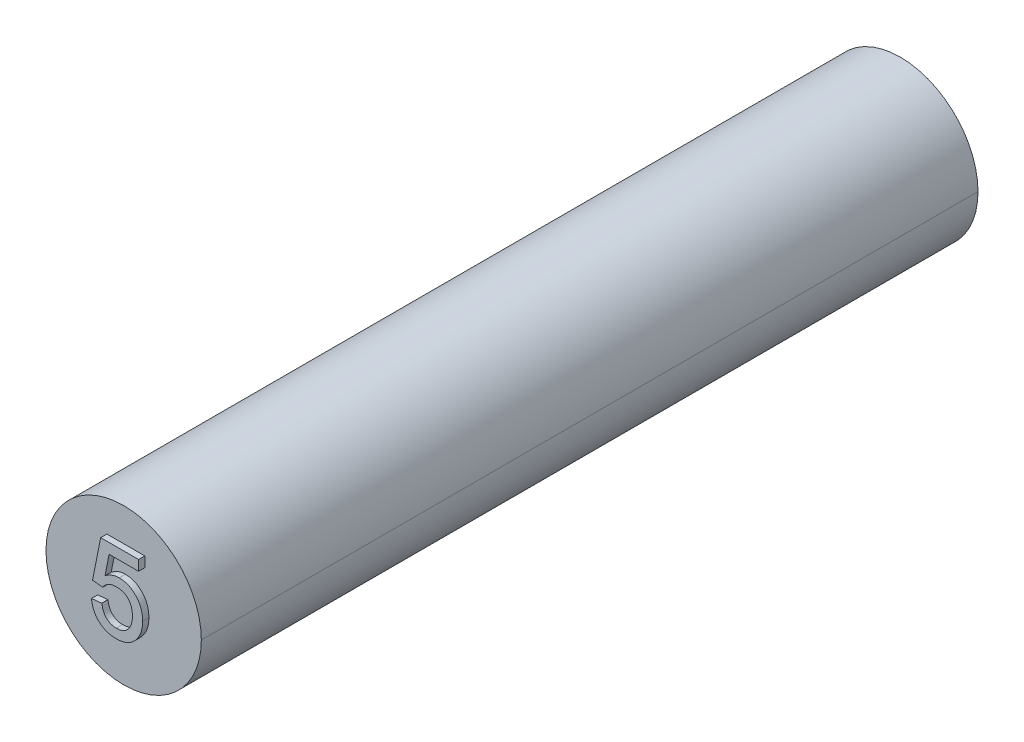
ISO-10303-21;
HEADER;
FILE_DESCRIPTION(('STEP AP214'),'2;1');
FILE_NAME('part.step','',(''),(''),'','','');
FILE_SCHEMA(('AUTOMOTIVE_DESIGN { 1 0 10303 214 1 1 1 1 }'));
ENDSEC;
DATA;
#1=APPLICATION_CONTEXT('core data for automotive mechanical design processes');
#2=APPLICATION_PROTOCOL_DEFINITION('international standard','automotive_design',2000,#1);
#3=PRODUCT_CONTEXT('',#1,'mechanical');
#4=PRODUCT('Part','Part','',(#3));
#5=PRODUCT_RELATED_PRODUCT_CATEGORY('part','',(#4));
#6=PRODUCT_DEFINITION_FORMATION('','',#4);
#7=PRODUCT_DEFINITION_CONTEXT('part definition',#1,'design');
#8=PRODUCT_DEFINITION('design','',#6,#7);
#9=PRODUCT_DEFINITION_SHAPE('','',#8);
#10=(LENGTH_UNIT() NAMED_UNIT(*) SI_UNIT(.MILLI.,.METRE.));
#11=(NAMED_UNIT(*) PLANE_ANGLE_UNIT() SI_UNIT($,.RADIAN.));
#12=(NAMED_UNIT(*) SI_UNIT($,.STERADIAN.) SOLID_ANGLE_UNIT());
#13=UNCERTAINTY_MEASURE_WITH_UNIT(LENGTH_MEASURE(1.E-05),#10,'distance_accuracy_value','');
#14=(GEOMETRIC_REPRESENTATION_CONTEXT(3) GLOBAL_UNCERTAINTY_ASSIGNED_CONTEXT((#13)) GLOBAL_UNIT_ASSIGNED_CONTEXT((#10,
#11,#12)) REPRESENTATION_CONTEXT('',''));
#15=CARTESIAN_POINT('',(0.,0.,0.));
#16=DIRECTION('',(0.,0.,1.));
#17=DIRECTION('',(1.,0.,0.));
#18=AXIS2_PLACEMENT_3D('',#15,#16,#17);
#19=CARTESIAN_POINT('',(-0.587898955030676,-0.937685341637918,0.2));
#20=DIRECTION('',(0.,0.,1.));
#21=DIRECTION('',(1.,0.,0.));
#22=AXIS2_PLACEMENT_3D('',#19,#20,#21);
#23=PLANE('',#22);
#24=CARTESIAN_POINT('',(-0.0373949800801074,-1.13292716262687,0.2));
#25=CARTESIAN_POINT('',(-0.0650337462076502,-1.1323665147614,0.2));
#26=CARTESIAN_POINT('',(-0.119100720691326,-1.13126977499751,0.2));
#27=CARTESIAN_POINT('',(-0.198264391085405,-1.12173523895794,0.2));
#28=CARTESIAN_POINT('',(-0.273558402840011,-1.1065310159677,0.2));
#29=CARTESIAN_POINT('',(-0.345006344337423,-1.08472345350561,0.2));
#30=CARTESIAN_POINT('',(-0.412823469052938,-1.05716755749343,0.2));
#31=CARTESIAN_POINT('',(-0.476221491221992,-1.02216212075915,0.2));
#32=CARTESIAN_POINT('',(-0.53630061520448,-0.982118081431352,0.2));
#33=CARTESIAN_POINT('',(-0.591739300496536,-0.935801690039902,0.2));
#34=CARTESIAN_POINT('',(-0.642251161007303,-0.884141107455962,0.2));
#35=CARTESIAN_POINT('',(-0.687510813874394,-0.828230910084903,0.2));
#36=CARTESIAN_POINT('',(-0.726905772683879,-0.768034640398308,0.2));
#37=CARTESIAN_POINT('',(-0.760417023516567,-0.703912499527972,0.2));
#38=CARTESIAN_POINT('',(-0.788347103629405,-0.635925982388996,0.2));
#39=CARTESIAN_POINT('',(-0.80971471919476,-0.563611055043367,0.2));
#40=CARTESIAN_POINT('',(-0.826639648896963,-0.48767723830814,0.2));
#41=CARTESIAN_POINT('',(-0.832425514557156,-0.435188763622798,0.2));
#42=CARTESIAN_POINT('',(-0.835364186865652,-0.408529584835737,0.2));
#43=(BOUNDED_CURVE() B_SPLINE_CURVE(3,(#24,#25,#26,#27,#28,#29,#30,#31,#32,#33,#34,#35,#36,#37,
#38,#39,#40,#41,#42),.UNSPECIFIED.,.F.,.F.) B_SPLINE_CURVE_WITH_KNOTS((4,1,1,1,1,1,1,1,1,1,1,1,
1,1,1,1,4),(0.,0.0692980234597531,0.135560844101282,0.199670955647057,0.261716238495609,
0.322661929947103,0.382906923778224,0.443032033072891,0.503500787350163,0.563724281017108,
0.623980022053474,0.683629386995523,0.743848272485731,0.80519184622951,0.867648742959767,
0.932778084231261,1.),
.UNSPECIFIED.) CURVE() GEOMETRIC_REPRESENTATION_ITEM() RATIONAL_B_SPLINE_CURVE((1.,1.,1.,1.,1.,
1.,1.,1.,1.,1.,1.,1.,1.,1.,1.,1.,1.,1.,1.)) REPRESENTATION_ITEM(''));
#44=CARTESIAN_POINT('',(-0.0373949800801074,-1.13292716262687,0.2));
#45=VERTEX_POINT('',#44);
#46=CARTESIAN_POINT('',(-0.835364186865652,-0.408529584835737,0.2));
#47=VERTEX_POINT('',#46);
#48=EDGE_CURVE('E345',#45,#47,#43,.T.);
#49=ORIENTED_EDGE('',*,*,#48,.F.);
#50=CARTESIAN_POINT('',(0.614459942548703,-0.821148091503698,0.2));
#51=CARTESIAN_POINT('',(0.594284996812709,-0.846023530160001,0.2));
#52=CARTESIAN_POINT('',(0.554598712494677,-0.894956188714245,0.2));
#53=CARTESIAN_POINT('',(0.485882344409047,-0.958467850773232,0.2));
#54=CARTESIAN_POINT('',(0.412011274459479,-1.01244402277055,0.2));
#55=CARTESIAN_POINT('',(0.33254588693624,-1.05629575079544,0.2));
#56=CARTESIAN_POINT('',(0.248019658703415,-1.0915343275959,0.2));
#57=CARTESIAN_POINT('',(0.157394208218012,-1.11498427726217,0.2));
#58=CARTESIAN_POINT('',(0.061764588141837,-1.13073184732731,0.2));
#59=CARTESIAN_POINT('',(-0.00388700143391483,-1.13218532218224,0.2));
#60=CARTESIAN_POINT('',(-0.0373949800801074,-1.13292716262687,0.2));
#61=(BOUNDED_CURVE() B_SPLINE_CURVE(3,(#50,#51,#52,#53,#54,#55,#56,#57,#58,#59,#60),
.UNSPECIFIED.,.F.,.F.) B_SPLINE_CURVE_WITH_KNOTS((4,1,1,1,1,1,1,1,4),(0.,0.127892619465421,
0.251578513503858,0.372792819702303,0.492777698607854,0.613590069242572,0.737808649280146,
0.866179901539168,1.),
.UNSPECIFIED.) CURVE() GEOMETRIC_REPRESENTATION_ITEM() RATIONAL_B_SPLINE_CURVE((1.,1.,1.,1.,1.,
1.,1.,1.,1.,1.,1.)) REPRESENTATION_ITEM(''));
#62=CARTESIAN_POINT('',(0.614459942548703,-0.821148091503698,0.2));
#63=VERTEX_POINT('',#62);
#64=EDGE_CURVE('E360',#63,#45,#61,.T.);
#65=ORIENTED_EDGE('',*,*,#64,.F.);
#66=CARTESIAN_POINT('',(0.810993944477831,-0.219198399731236,0.2));
#67=CARTESIAN_POINT('',(0.810410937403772,-0.247690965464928,0.2));
#68=CARTESIAN_POINT('',(0.809259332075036,-0.303971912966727,0.2));
#69=CARTESIAN_POINT('',(0.799821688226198,-0.386912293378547,0.2));
#70=CARTESIAN_POINT('',(0.784275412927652,-0.466831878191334,0.2));
#71=CARTESIAN_POINT('',(0.76346324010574,-0.543967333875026,0.2));
#72=CARTESIAN_POINT('',(0.735343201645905,-0.617880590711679,0.2));
#73=CARTESIAN_POINT('',(0.701236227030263,-0.688810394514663,0.2));
#74=CARTESIAN_POINT('',(0.661891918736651,-0.757496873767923,0.2));
#75=CARTESIAN_POINT('',(0.630339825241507,-0.79983812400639,0.2));
#76=CARTESIAN_POINT('',(0.614459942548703,-0.821148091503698,0.2));
#77=(BOUNDED_CURVE() B_SPLINE_CURVE(3,(#66,#67,#68,#69,#70,#71,#72,#73,#74,#75,#76),
.UNSPECIFIED.,.F.,.F.) B_SPLINE_CURVE_WITH_KNOTS((4,1,1,1,1,1,1,1,4),(0.,0.132461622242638,
0.261649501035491,0.387546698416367,0.510781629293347,0.632675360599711,0.754660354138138,
0.876522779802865,1.),
.UNSPECIFIED.) CURVE() GEOMETRIC_REPRESENTATION_ITEM() RATIONAL_B_SPLINE_CURVE((1.,1.,1.,1.,1.,
1.,1.,1.,1.,1.,1.)) REPRESENTATION_ITEM(''));
#78=CARTESIAN_POINT('',(0.810993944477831,-0.219198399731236,0.2));
#79=VERTEX_POINT('',#78);
#80=EDGE_CURVE('E371',#79,#63,#77,.T.);
#81=ORIENTED_EDGE('',*,*,#80,.F.);
#82=CARTESIAN_POINT('',(0.057270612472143,0.612212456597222,0.2));
#83=CARTESIAN_POINT('',(0.0832021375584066,0.611533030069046,0.2));
#84=CARTESIAN_POINT('',(0.134267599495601,0.610195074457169,0.2));
#85=CARTESIAN_POINT('',(0.209514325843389,0.599202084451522,0.2));
#86=CARTESIAN_POINT('',(0.281462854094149,0.580540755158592,0.2));
#87=CARTESIAN_POINT('',(0.350677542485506,0.555406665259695,0.2));
#88=CARTESIAN_POINT('',(0.416245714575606,0.522087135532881,0.2));
#89=CARTESIAN_POINT('',(0.478831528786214,0.481744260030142,0.2));
#90=CARTESIAN_POINT('',(0.538182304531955,0.434045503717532,0.2));
#91=CARTESIAN_POINT('',(0.593962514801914,0.379890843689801,0.2));
#92=CARTESIAN_POINT('',(0.644557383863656,0.319773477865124,0.2));
#93=CARTESIAN_POINT('',(0.68984144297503,0.2556540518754,0.2));
#94=CARTESIAN_POINT('',(0.726826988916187,0.186249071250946,0.2));
#95=CARTESIAN_POINT('',(0.757934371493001,0.113370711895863,0.2));
#96=CARTESIAN_POINT('',(0.781396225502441,0.0358226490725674,0.2));
#97=CARTESIAN_POINT('',(0.799204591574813,-0.0452945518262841,0.2));
#98=CARTESIAN_POINT('',(0.808726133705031,-0.130995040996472,0.2));
#99=CARTESIAN_POINT('',(0.81022617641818,-0.189337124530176,0.2));
#100=CARTESIAN_POINT('',(0.810993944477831,-0.219198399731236,0.2));
#101=(BOUNDED_CURVE() B_SPLINE_CURVE(3,(#82,#83,#84,#85,#86,#87,#88,#89,#90,#91,#92,#93,#94,#95,
#96,#97,#98,#99,#100),.UNSPECIFIED.,.F.,.F.) B_SPLINE_CURVE_WITH_KNOTS((4,1,1,1,1,1,1,1,1,1,1,1,
1,1,1,1,4),(0.,0.0619974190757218,0.122087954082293,0.181375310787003,0.239508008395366,
0.297835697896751,0.356879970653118,0.417281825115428,0.479640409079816,0.542500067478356,
0.60496241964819,0.666991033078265,0.730216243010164,0.794172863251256,0.860458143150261,
0.928578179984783,1.),
.UNSPECIFIED.) CURVE() GEOMETRIC_REPRESENTATION_ITEM() RATIONAL_B_SPLINE_CURVE((1.,1.,1.,1.,1.,
1.,1.,1.,1.,1.,1.,1.,1.,1.,1.,1.,1.,1.,1.)) REPRESENTATION_ITEM(''));
#102=CARTESIAN_POINT('',(0.057270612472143,0.612212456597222,0.2));
#103=VERTEX_POINT('',#102);
#104=EDGE_CURVE('E382',#103,#79,#101,.T.);
#105=ORIENTED_EDGE('',*,*,#104,.F.);
#106=CARTESIAN_POINT('',(-0.400622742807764,0.440888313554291,0.2));
#107=CARTESIAN_POINT('',(-0.382454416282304,0.454522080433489,0.2));
#108=CARTESIAN_POINT('',(-0.346774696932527,0.481296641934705,0.2));
#109=CARTESIAN_POINT('',(-0.29112073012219,0.516354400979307,0.2));
#110=CARTESIAN_POINT('',(-0.234670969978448,0.545905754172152,0.2));
#111=CARTESIAN_POINT('',(-0.177754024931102,0.570105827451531,0.2));
#112=CARTESIAN_POINT('',(-0.119917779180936,0.588957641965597,0.2));
#113=CARTESIAN_POINT('',(-0.0615112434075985,0.602055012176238,0.2));
#114=CARTESIAN_POINT('',(-0.00233555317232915,0.610906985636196,0.2));
#115=CARTESIAN_POINT('',(0.0373452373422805,0.611776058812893,0.2));
#116=CARTESIAN_POINT('',(0.057270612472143,0.612212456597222,0.2));
#117=(BOUNDED_CURVE() B_SPLINE_CURVE(3,(#106,#107,#108,#109,#110,#111,#112,#113,#114,#115,#116),
.UNSPECIFIED.,.F.,.F.) B_SPLINE_CURVE_WITH_KNOTS((4,1,1,1,1,1,1,1,4),(0.,0.136729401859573,
0.26851491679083,0.395529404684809,0.519999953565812,0.640496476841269,0.761236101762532,
0.880106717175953,1.),
.UNSPECIFIED.) CURVE() GEOMETRIC_REPRESENTATION_ITEM() RATIONAL_B_SPLINE_CURVE((1.,1.,1.,1.,1.,
1.,1.,1.,1.,1.,1.)) REPRESENTATION_ITEM(''));
#118=CARTESIAN_POINT('',(-0.400622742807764,0.440888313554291,0.2));
#119=VERTEX_POINT('',#118);
#120=EDGE_CURVE('E393',#119,#103,#117,.T.);
#121=ORIENTED_EDGE('',*,*,#120,.F.);
#122=DIRECTION('',(-0.19275835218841,-0.981246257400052,0.));
#123=VECTOR('',#122,1.);
#124=CARTESIAN_POINT('',(-0.269943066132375,1.10611989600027,0.2));
#125=LINE('',#124,#123);
#126=CARTESIAN_POINT('',(-0.269943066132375,1.10611989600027,0.2));
#127=VERTEX_POINT('',#126);
#128=EDGE_CURVE('E404',#127,#119,#125,.T.);
#129=ORIENTED_EDGE('',*,*,#128,.F.);
#130=DIRECTION('',(-1.,0.,0.));
#131=VECTOR('',#130,1.);
#132=CARTESIAN_POINT('',(0.679285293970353,1.10611989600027,0.2));
#133=LINE('',#132,#131);
#134=CARTESIAN_POINT('',(0.679285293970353,1.10611989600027,0.2));
#135=VERTEX_POINT('',#134);
#136=EDGE_CURVE('E210',#135,#127,#133,.T.);
#137=ORIENTED_EDGE('',*,*,#136,.F.);
#138=DIRECTION('',(0.,-1.,0.));
#139=VECTOR('',#138,1.);
#140=CARTESIAN_POINT('',(0.679285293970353,1.43539152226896,0.2));
#141=LINE('',#140,#139);
#142=CARTESIAN_POINT('',(0.679285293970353,1.43539152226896,0.2));
#143=VERTEX_POINT('',#142);
#144=EDGE_CURVE('E243',#143,#135,#141,.T.);
#145=ORIENTED_EDGE('',*,*,#144,.F.);
#146=DIRECTION('',(1.,0.,0.));
#147=VECTOR('',#146,1.);
#148=CARTESIAN_POINT('',(-0.539019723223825,1.43539152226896,0.2));
#149=LINE('',#148,#147);
#150=CARTESIAN_POINT('',(-0.539019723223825,1.43539152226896,0.2));
#151=VERTEX_POINT('',#150);
#152=EDGE_CURVE('E411',#151,#143,#149,.T.);
#153=ORIENTED_EDGE('',*,*,#152,.F.);
#154=DIRECTION('',(0.196116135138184,0.98058067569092,0.));
#155=VECTOR('',#154,1.);
#156=CARTESIAN_POINT('',(-0.802437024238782,0.118305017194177,0.2));
#157=LINE('',#156,#155);
#158=CARTESIAN_POINT('',(-0.802437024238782,0.118305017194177,0.2));
#159=VERTEX_POINT('',#158);
#160=EDGE_CURVE('E417',#159,#151,#157,.T.);
#161=ORIENTED_EDGE('',*,*,#160,.F.);
#162=DIRECTION('',(-0.995037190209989,0.0995037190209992,0.));
#163=VECTOR('',#162,1.);
#164=CARTESIAN_POINT('',(-0.473165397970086,0.0853778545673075,0.2));
#165=LINE('',#164,#163);
#166=CARTESIAN_POINT('',(-0.473165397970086,0.0853778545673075,0.2));
#167=VERTEX_POINT('',#166);
#168=EDGE_CURVE('E290',#167,#159,#165,.T.);
#169=ORIENTED_EDGE('',*,*,#168,.F.);
#170=CARTESIAN_POINT('',(-0.0337935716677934,0.315867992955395,0.2));
#171=CARTESIAN_POINT('',(-0.0593995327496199,0.31511896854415,0.2));
#172=CARTESIAN_POINT('',(-0.10850597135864,0.313682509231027,0.2));
#173=CARTESIAN_POINT('',(-0.17906687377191,0.301598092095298,0.2));
#174=CARTESIAN_POINT('',(-0.243301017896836,0.282077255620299,0.2));
#175=CARTESIAN_POINT('',(-0.300481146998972,0.252983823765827,0.2));
#176=CARTESIAN_POINT('',(-0.351568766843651,0.218226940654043,0.2));
#177=CARTESIAN_POINT('',(-0.397625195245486,0.178897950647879,0.2));
#178=CARTESIAN_POINT('',(-0.439030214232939,0.135023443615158,0.2));
#179=CARTESIAN_POINT('',(-0.461742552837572,0.101991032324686,0.2));
#180=CARTESIAN_POINT('',(-0.473165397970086,0.0853778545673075,0.2));
#181=(BOUNDED_CURVE() B_SPLINE_CURVE(3,(#170,#171,#172,#173,#174,#175,#176,#177,#178,#179,#180),
.UNSPECIFIED.,.F.,.F.) B_SPLINE_CURVE_WITH_KNOTS((4,1,1,1,1,1,1,1,4),(0.,0.147859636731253,
0.283561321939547,0.412369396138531,0.534236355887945,0.652691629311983,0.768663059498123,
0.883652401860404,1.),
.UNSPECIFIED.) CURVE() GEOMETRIC_REPRESENTATION_ITEM() RATIONAL_B_SPLINE_CURVE((1.,1.,1.,1.,1.,
1.,1.,1.,1.,1.,1.)) REPRESENTATION_ITEM(''));
#182=CARTESIAN_POINT('',(-0.0337935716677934,0.315867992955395,0.2));
#183=VERTEX_POINT('',#182);
#184=EDGE_CURVE('E289',#183,#167,#181,.T.);
#185=ORIENTED_EDGE('',*,*,#184,.F.);
#186=CARTESIAN_POINT('',(0.481722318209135,-0.23874890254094,0.2));
#187=CARTESIAN_POINT('',(0.481344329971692,-0.217811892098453,0.2));
#188=CARTESIAN_POINT('',(0.480608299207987,-0.177042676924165,0.2));
#189=CARTESIAN_POINT('',(0.474409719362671,-0.117675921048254,0.2));
#190=CARTESIAN_POINT('',(0.463951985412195,-0.0618532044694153,0.2));
#191=CARTESIAN_POINT('',(0.450420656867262,-0.00895926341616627,0.2));
#192=CARTESIAN_POINT('',(0.431769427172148,0.0401793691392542,0.2));
#193=CARTESIAN_POINT('',(0.409648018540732,0.0862751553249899,0.2));
#194=CARTESIAN_POINT('',(0.382548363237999,0.128349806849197,0.2));
#195=CARTESIAN_POINT('',(0.352398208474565,0.167713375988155,0.2));
#196=CARTESIAN_POINT('',(0.31796292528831,0.203001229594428,0.2));
#197=CARTESIAN_POINT('',(0.278777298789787,0.232797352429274,0.2));
#198=CARTESIAN_POINT('',(0.236378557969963,0.258874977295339,0.2));
#199=CARTESIAN_POINT('',(0.189912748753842,0.280022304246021,0.2));
#200=CARTESIAN_POINT('',(0.139352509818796,0.295733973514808,0.2));
#201=CARTESIAN_POINT('',(0.0852002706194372,0.307822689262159,0.2));
#202=CARTESIAN_POINT('',(0.0268941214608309,0.314180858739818,0.2));
#203=CARTESIAN_POINT('',(-0.0132009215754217,0.315295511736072,0.2));
#204=CARTESIAN_POINT('',(-0.0337935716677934,0.315867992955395,0.2));
#205=(BOUNDED_CURVE() B_SPLINE_CURVE(3,(#186,#187,#188,#189,#190,#191,#192,#193,#194,#195,#196,
#197,#198,#199,#200,#201,#202,#203,#204),.UNSPECIFIED.,.F.,.F.) B_SPLINE_CURVE_WITH_KNOTS((4,1,
1,1,1,1,1,1,1,1,1,1,1,1,1,1,4),(0.,0.072865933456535,0.141886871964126,0.207452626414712,
0.270437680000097,0.331640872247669,0.390107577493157,0.448069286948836,0.505502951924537,
0.562488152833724,0.619084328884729,0.676415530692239,0.735452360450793,0.796240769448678,
0.860405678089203,0.928304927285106,1.),
.UNSPECIFIED.) CURVE() GEOMETRIC_REPRESENTATION_ITEM() RATIONAL_B_SPLINE_CURVE((1.,1.,1.,1.,1.,
1.,1.,1.,1.,1.,1.,1.,1.,1.,1.,1.,1.,1.,1.)) REPRESENTATION_ITEM(''));
#206=CARTESIAN_POINT('',(0.481722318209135,-0.23874890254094,0.2));
#207=VERTEX_POINT('',#206);
#208=EDGE_CURVE('E427',#207,#183,#205,.T.);
#209=ORIENTED_EDGE('',*,*,#208,.F.);
#210=CARTESIAN_POINT('',(-0.035337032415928,-0.836582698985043,0.2));
#211=CARTESIAN_POINT('',(-0.015760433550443,-0.836109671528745,0.2));
#212=CARTESIAN_POINT('',(0.0225224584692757,-0.835184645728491,0.2));
#213=CARTESIAN_POINT('',(0.0782168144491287,-0.827361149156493,0.2));
#214=CARTESIAN_POINT('',(0.130824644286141,-0.814461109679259,0.2));
#215=CARTESIAN_POINT('',(0.180094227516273,-0.796408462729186,0.2));
#216=CARTESIAN_POINT('',(0.22660315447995,-0.773957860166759,0.2));
#217=CARTESIAN_POINT('',(0.268808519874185,-0.744888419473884,0.2));
#218=CARTESIAN_POINT('',(0.309011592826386,-0.712211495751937,0.2));
#219=CARTESIAN_POINT('',(0.344625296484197,-0.673254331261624,0.2));
#220=CARTESIAN_POINT('',(0.377043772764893,-0.630842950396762,0.2));
#221=CARTESIAN_POINT('',(0.405023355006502,-0.58454912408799,0.2));
#222=CARTESIAN_POINT('',(0.428578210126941,-0.535022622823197,0.2));
#223=CARTESIAN_POINT('',(0.448408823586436,-0.482272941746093,0.2));
#224=CARTESIAN_POINT('',(0.463052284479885,-0.425998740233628,0.2));
#225=CARTESIAN_POINT('',(0.473823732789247,-0.366499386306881,0.2));
#226=CARTESIAN_POINT('',(0.480738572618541,-0.303736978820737,0.2));
#227=CARTESIAN_POINT('',(0.481389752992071,-0.260718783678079,0.2));
#228=CARTESIAN_POINT('',(0.481722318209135,-0.23874890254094,0.2));
#229=(BOUNDED_CURVE() B_SPLINE_CURVE(3,(#210,#211,#212,#213,#214,#215,#216,#217,#218,#219,#220,
#221,#222,#223,#224,#225,#226,#227,#228),.UNSPECIFIED.,.F.,.F.) B_SPLINE_CURVE_WITH_KNOTS((4,1,
1,1,1,1,1,1,1,1,1,1,1,1,1,1,4),(0.,0.0658010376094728,0.128676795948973,0.188675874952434,
0.247598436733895,0.304849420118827,0.361785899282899,0.41952270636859,0.47868181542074,
0.538769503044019,0.598799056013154,0.660184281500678,0.722951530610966,0.787992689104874,
0.855403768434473,0.926153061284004,1.),
.UNSPECIFIED.) CURVE() GEOMETRIC_REPRESENTATION_ITEM() RATIONAL_B_SPLINE_CURVE((1.,1.,1.,1.,1.,
1.,1.,1.,1.,1.,1.,1.,1.,1.,1.,1.,1.,1.,1.)) REPRESENTATION_ITEM(''));
#230=CARTESIAN_POINT('',(-0.035337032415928,-0.836582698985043,0.2));
#231=VERTEX_POINT('',#230);
#232=EDGE_CURVE('E438',#231,#207,#229,.T.);
#233=ORIENTED_EDGE('',*,*,#232,.F.);
#234=CARTESIAN_POINT('',(-0.506092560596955,-0.375602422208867,0.2));
#235=CARTESIAN_POINT('',(-0.502832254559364,-0.394155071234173,0.2));
#236=CARTESIAN_POINT('',(-0.49649045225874,-0.430242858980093,0.2));
#237=CARTESIAN_POINT('',(-0.484405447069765,-0.48248100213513,0.2));
#238=CARTESIAN_POINT('',(-0.468710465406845,-0.531011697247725,0.2));
#239=CARTESIAN_POINT('',(-0.451075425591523,-0.576255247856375,0.2));
#240=CARTESIAN_POINT('',(-0.430113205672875,-0.617733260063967,0.2));
#241=CARTESIAN_POINT('',(-0.407400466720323,-0.656100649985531,0.2));
#242=CARTESIAN_POINT('',(-0.380615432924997,-0.689995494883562,0.2));
#243=CARTESIAN_POINT('',(-0.35245456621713,-0.721190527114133,0.2));
#244=CARTESIAN_POINT('',(-0.321545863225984,-0.74867886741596,0.2));
#245=CARTESIAN_POINT('',(-0.287591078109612,-0.771852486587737,0.2));
#246=CARTESIAN_POINT('',(-0.251537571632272,-0.792070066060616,0.2));
#247=CARTESIAN_POINT('',(-0.212946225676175,-0.8086233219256,0.2));
#248=CARTESIAN_POINT('',(-0.17175789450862,-0.820739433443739,0.2));
#249=CARTESIAN_POINT('',(-0.128496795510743,-0.830321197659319,0.2));
#250=CARTESIAN_POINT('',(-0.082605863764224,-0.83514940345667,0.2));
#251=CARTESIAN_POINT('',(-0.0512947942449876,-0.836098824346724,0.2));
#252=CARTESIAN_POINT('',(-0.035337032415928,-0.836582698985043,0.2));
#253=(BOUNDED_CURVE() B_SPLINE_CURVE(3,(#234,#235,#236,#237,#238,#239,#240,#241,#242,#243,#244,
#245,#246,#247,#248,#249,#250,#251,#252),.UNSPECIFIED.,.F.,.F.) B_SPLINE_CURVE_WITH_KNOTS((4,1,
1,1,1,1,1,1,1,1,1,1,1,1,1,1,4),(0.,0.0773613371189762,0.15047983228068,0.219977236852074,
0.286680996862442,0.349678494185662,0.410679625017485,0.469427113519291,0.52675570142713,
0.583141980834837,0.638824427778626,0.695263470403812,0.752695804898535,0.810849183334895,
0.871356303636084,0.934436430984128,1.),
.UNSPECIFIED.) CURVE() GEOMETRIC_REPRESENTATION_ITEM() RATIONAL_B_SPLINE_CURVE((1.,1.,1.,1.,1.,
1.,1.,1.,1.,1.,1.,1.,1.,1.,1.,1.,1.,1.,1.)) REPRESENTATION_ITEM(''));
#254=CARTESIAN_POINT('',(-0.506092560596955,-0.375602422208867,0.2));
#255=VERTEX_POINT('',#254);
#256=EDGE_CURVE('E23',#255,#231,#253,.T.);
#257=ORIENTED_EDGE('',*,*,#256,.F.);
#258=DIRECTION('',(0.995037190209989,0.0995037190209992,0.));
#259=VECTOR('',#258,1.);
#260=CARTESIAN_POINT('',(-0.835364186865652,-0.408529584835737,0.2));
#261=LINE('',#260,#259);
#262=EDGE_CURVE('E9',#47,#255,#261,.T.);
#263=ORIENTED_EDGE('',*,*,#262,.F.);
#264=EDGE_LOOP('',(#49,#65,#81,#105,#121,#129,#137,#145,#153,#161,#169,#185,#209,#233,#257,#263));
#265=FACE_BOUND('',#264,.T.);
#266=ADVANCED_FACE('F15',(#265),#23,.T.);
#267=CARTESIAN_POINT('',(-0.835364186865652,-0.408529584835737,0.2));
#268=DIRECTION('',(-0.0995037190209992,0.995037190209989,0.));
#269=DIRECTION('',(0.,0.,1.));
#270=AXIS2_PLACEMENT_3D('',#267,#268,#269);
#271=PLANE('',#270);
#272=DIRECTION('',(0.995037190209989,0.0995037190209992,0.));
#273=VECTOR('',#272,1.);
#274=CARTESIAN_POINT('',(-0.835364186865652,-0.408529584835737,0.));
#275=LINE('',#274,#273);
#276=CARTESIAN_POINT('',(-0.835364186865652,-0.408529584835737,0.));
#277=VERTEX_POINT('',#276);
#278=CARTESIAN_POINT('',(-0.506092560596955,-0.375602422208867,0.));
#279=VERTEX_POINT('',#278);
#280=EDGE_CURVE('E219',#277,#279,#275,.T.);
#281=ORIENTED_EDGE('',*,*,#280,.F.);
#282=DIRECTION('',(0.,0.,-1.));
#283=VECTOR('',#282,1.);
#284=CARTESIAN_POINT('',(-0.835364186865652,-0.408529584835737,0.2));
#285=LINE('',#284,#283);
#286=EDGE_CURVE('E351',#47,#277,#285,.T.);
#287=ORIENTED_EDGE('',*,*,#286,.F.);
#288=ORIENTED_EDGE('',*,*,#262,.T.);
#289=DIRECTION('',(0.,0.,-1.));
#290=VECTOR('',#289,1.);
#291=CARTESIAN_POINT('',(-0.506092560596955,-0.375602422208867,0.2));
#292=LINE('',#291,#290);
#293=EDGE_CURVE('E443',#255,#279,#292,.T.);
#294=ORIENTED_EDGE('',*,*,#293,.T.);
#295=EDGE_LOOP('',(#281,#287,#288,#294));
#296=FACE_BOUND('',#295,.T.);
#297=ADVANCED_FACE('F640',(#296),#271,.T.);
#298=CARTESIAN_POINT('',(-0.506092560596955,-0.375602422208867,0.2));
#299=CARTESIAN_POINT('',(-0.506092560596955,-0.375602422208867,0.));
#300=CARTESIAN_POINT('',(-0.502832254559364,-0.394155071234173,0.2));
#301=CARTESIAN_POINT('',(-0.502832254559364,-0.394155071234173,0.));
#302=CARTESIAN_POINT('',(-0.49649045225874,-0.430242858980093,0.2));
#303=CARTESIAN_POINT('',(-0.49649045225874,-0.430242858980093,0.));
#304=CARTESIAN_POINT('',(-0.484405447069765,-0.48248100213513,0.2));
#305=CARTESIAN_POINT('',(-0.484405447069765,-0.48248100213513,0.));
#306=CARTESIAN_POINT('',(-0.468710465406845,-0.531011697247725,0.2));
#307=CARTESIAN_POINT('',(-0.468710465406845,-0.531011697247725,0.));
#308=CARTESIAN_POINT('',(-0.451075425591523,-0.576255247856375,0.2));
#309=CARTESIAN_POINT('',(-0.451075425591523,-0.576255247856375,0.));
#310=CARTESIAN_POINT('',(-0.430113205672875,-0.617733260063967,0.2));
#311=CARTESIAN_POINT('',(-0.430113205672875,-0.617733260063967,0.));
#312=CARTESIAN_POINT('',(-0.407400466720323,-0.656100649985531,0.2));
#313=CARTESIAN_POINT('',(-0.407400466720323,-0.656100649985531,0.));
#314=CARTESIAN_POINT('',(-0.380615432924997,-0.689995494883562,0.2));
#315=CARTESIAN_POINT('',(-0.380615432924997,-0.689995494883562,0.));
#316=CARTESIAN_POINT('',(-0.35245456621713,-0.721190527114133,0.2));
#317=CARTESIAN_POINT('',(-0.35245456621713,-0.721190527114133,0.));
#318=CARTESIAN_POINT('',(-0.321545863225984,-0.74867886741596,0.2));
#319=CARTESIAN_POINT('',(-0.321545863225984,-0.74867886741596,0.));
#320=CARTESIAN_POINT('',(-0.287591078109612,-0.771852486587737,0.2));
#321=CARTESIAN_POINT('',(-0.287591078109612,-0.771852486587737,0.));
#322=CARTESIAN_POINT('',(-0.251537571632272,-0.792070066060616,0.2));
#323=CARTESIAN_POINT('',(-0.251537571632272,-0.792070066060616,0.));
#324=CARTESIAN_POINT('',(-0.212946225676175,-0.8086233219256,0.2));
#325=CARTESIAN_POINT('',(-0.212946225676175,-0.8086233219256,0.));
#326=CARTESIAN_POINT('',(-0.17175789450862,-0.820739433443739,0.2));
#327=CARTESIAN_POINT('',(-0.17175789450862,-0.820739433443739,0.));
#328=CARTESIAN_POINT('',(-0.128496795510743,-0.830321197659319,0.2));
#329=CARTESIAN_POINT('',(-0.128496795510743,-0.830321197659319,0.));
#330=CARTESIAN_POINT('',(-0.082605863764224,-0.83514940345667,0.2));
#331=CARTESIAN_POINT('',(-0.082605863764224,-0.83514940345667,0.));
#332=CARTESIAN_POINT('',(-0.0512947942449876,-0.836098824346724,0.2));
#333=CARTESIAN_POINT('',(-0.0512947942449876,-0.836098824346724,0.));
#334=CARTESIAN_POINT('',(-0.035337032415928,-0.836582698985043,0.2));
#335=CARTESIAN_POINT('',(-0.035337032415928,-0.836582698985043,0.));
#336=(BOUNDED_SURFACE() B_SPLINE_SURFACE(3,1,((#298,#299),(#300,#301),(#302,#303),(#304,#305),
(#306,#307),(#308,#309),(#310,#311),(#312,#313),(#314,#315),(#316,#317),(#318,#319),(#320,#321),
(#322,#323),(#324,#325),(#326,#327),(#328,#329),(#330,#331),(#332,#333),(#334,#335)),
.UNSPECIFIED.,.F.,.F.,.F.) B_SPLINE_SURFACE_WITH_KNOTS((4,1,1,1,1,1,1,1,1,1,1,1,1,1,1,1,4),(2,
2),(0.,0.0773613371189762,0.15047983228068,0.219977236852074,0.286680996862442,
0.349678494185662,0.410679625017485,0.469427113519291,0.52675570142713,0.583141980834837,
0.638824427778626,0.695263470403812,0.752695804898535,0.810849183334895,0.871356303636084,
0.934436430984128,1.),(0.,1.),
.UNSPECIFIED.) GEOMETRIC_REPRESENTATION_ITEM() RATIONAL_B_SPLINE_SURFACE(((1.,1.),(1.,1.),(1.,
1.),(1.,1.),(1.,1.),(1.,1.),(1.,1.),(1.,1.),(1.,1.),(1.,1.),(1.,1.),(1.,1.),(1.,1.),(1.,1.),(1.,
1.),(1.,1.),(1.,1.),(1.,1.),(1.,1.))) REPRESENTATION_ITEM('') SURFACE());
#337=CARTESIAN_POINT('',(-0.506092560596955,-0.375602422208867,0.));
#338=CARTESIAN_POINT('',(-0.502832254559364,-0.394155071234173,0.));
#339=CARTESIAN_POINT('',(-0.49649045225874,-0.430242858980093,0.));
#340=CARTESIAN_POINT('',(-0.484405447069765,-0.48248100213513,0.));
#341=CARTESIAN_POINT('',(-0.468710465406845,-0.531011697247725,0.));
#342=CARTESIAN_POINT('',(-0.451075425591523,-0.576255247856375,0.));
#343=CARTESIAN_POINT('',(-0.430113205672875,-0.617733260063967,0.));
#344=CARTESIAN_POINT('',(-0.407400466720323,-0.656100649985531,0.));
#345=CARTESIAN_POINT('',(-0.380615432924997,-0.689995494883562,0.));
#346=CARTESIAN_POINT('',(-0.35245456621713,-0.721190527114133,0.));
#347=CARTESIAN_POINT('',(-0.321545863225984,-0.74867886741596,0.));
#348=CARTESIAN_POINT('',(-0.287591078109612,-0.771852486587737,0.));
#349=CARTESIAN_POINT('',(-0.251537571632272,-0.792070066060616,0.));
#350=CARTESIAN_POINT('',(-0.212946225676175,-0.8086233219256,0.));
#351=CARTESIAN_POINT('',(-0.17175789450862,-0.820739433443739,0.));
#352=CARTESIAN_POINT('',(-0.128496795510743,-0.830321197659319,0.));
#353=CARTESIAN_POINT('',(-0.082605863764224,-0.83514940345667,0.));
#354=CARTESIAN_POINT('',(-0.0512947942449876,-0.836098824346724,0.));
#355=CARTESIAN_POINT('',(-0.035337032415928,-0.836582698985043,0.));
#356=(BOUNDED_CURVE() B_SPLINE_CURVE(3,(#337,#338,#339,#340,#341,#342,#343,#344,#345,#346,#347,
#348,#349,#350,#351,#352,#353,#354,#355),.UNSPECIFIED.,.F.,.F.) B_SPLINE_CURVE_WITH_KNOTS((4,1,
1,1,1,1,1,1,1,1,1,1,1,1,1,1,4),(0.,0.0773613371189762,0.15047983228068,0.219977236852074,
0.286680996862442,0.349678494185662,0.410679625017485,0.469427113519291,0.52675570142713,
0.583141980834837,0.638824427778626,0.695263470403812,0.752695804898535,0.810849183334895,
0.871356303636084,0.934436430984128,1.),
.UNSPECIFIED.) CURVE() GEOMETRIC_REPRESENTATION_ITEM() RATIONAL_B_SPLINE_CURVE((1.,1.,1.,1.,1.,
1.,1.,1.,1.,1.,1.,1.,1.,1.,1.,1.,1.,1.,1.)) REPRESENTATION_ITEM(''));
#357=CARTESIAN_POINT('',(-0.035337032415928,-0.836582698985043,0.));
#358=VERTEX_POINT('',#357);
#359=EDGE_CURVE('E246',#279,#358,#356,.T.);
#360=DIRECTION('',(0.,0.,-1.));
#361=VECTOR('',#360,1.);
#362=CARTESIAN_POINT('',(-0.035337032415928,-0.836582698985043,0.2));
#363=LINE('',#362,#361);
#364=EDGE_CURVE('E432',#231,#358,#363,.T.);
#365=ORIENTED_EDGE('',*,*,#359,.F.);
#366=ORIENTED_EDGE('',*,*,#293,.F.);
#367=ORIENTED_EDGE('',*,*,#256,.T.);
#368=ORIENTED_EDGE('',*,*,#364,.T.);
#369=EDGE_LOOP('',(#365,#366,#367,#368));
#370=FACE_BOUND('',#369,.T.);
#371=ADVANCED_FACE('F630',(#370),#336,.T.);
#372=CARTESIAN_POINT('',(-0.035337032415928,-0.836582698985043,0.2));
#373=CARTESIAN_POINT('',(-0.035337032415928,-0.836582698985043,0.));
#374=CARTESIAN_POINT('',(-0.015760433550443,-0.836109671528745,0.2));
#375=CARTESIAN_POINT('',(-0.015760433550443,-0.836109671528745,0.));
#376=CARTESIAN_POINT('',(0.0225224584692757,-0.835184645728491,0.2));
#377=CARTESIAN_POINT('',(0.0225224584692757,-0.835184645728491,0.));
#378=CARTESIAN_POINT('',(0.0782168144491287,-0.827361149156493,0.2));
#379=CARTESIAN_POINT('',(0.0782168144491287,-0.827361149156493,0.));
#380=CARTESIAN_POINT('',(0.130824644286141,-0.814461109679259,0.2));
#381=CARTESIAN_POINT('',(0.130824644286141,-0.814461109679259,0.));
#382=CARTESIAN_POINT('',(0.180094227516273,-0.796408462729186,0.2));
#383=CARTESIAN_POINT('',(0.180094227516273,-0.796408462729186,0.));
#384=CARTESIAN_POINT('',(0.22660315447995,-0.773957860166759,0.2));
#385=CARTESIAN_POINT('',(0.22660315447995,-0.773957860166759,0.));
#386=CARTESIAN_POINT('',(0.268808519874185,-0.744888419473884,0.2));
#387=CARTESIAN_POINT('',(0.268808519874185,-0.744888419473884,0.));
#388=CARTESIAN_POINT('',(0.309011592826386,-0.712211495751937,0.2));
#389=CARTESIAN_POINT('',(0.309011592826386,-0.712211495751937,0.));
#390=CARTESIAN_POINT('',(0.344625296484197,-0.673254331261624,0.2));
#391=CARTESIAN_POINT('',(0.344625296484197,-0.673254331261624,0.));
#392=CARTESIAN_POINT('',(0.377043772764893,-0.630842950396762,0.2));
#393=CARTESIAN_POINT('',(0.377043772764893,-0.630842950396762,0.));
#394=CARTESIAN_POINT('',(0.405023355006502,-0.58454912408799,0.2));
#395=CARTESIAN_POINT('',(0.405023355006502,-0.58454912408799,0.));
#396=CARTESIAN_POINT('',(0.428578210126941,-0.535022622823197,0.2));
#397=CARTESIAN_POINT('',(0.428578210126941,-0.535022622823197,0.));
#398=CARTESIAN_POINT('',(0.448408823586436,-0.482272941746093,0.2));
#399=CARTESIAN_POINT('',(0.448408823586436,-0.482272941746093,0.));
#400=CARTESIAN_POINT('',(0.463052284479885,-0.425998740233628,0.2));
#401=CARTESIAN_POINT('',(0.463052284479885,-0.425998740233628,0.));
#402=CARTESIAN_POINT('',(0.473823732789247,-0.366499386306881,0.2));
#403=CARTESIAN_POINT('',(0.473823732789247,-0.366499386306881,0.));
#404=CARTESIAN_POINT('',(0.480738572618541,-0.303736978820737,0.2));
#405=CARTESIAN_POINT('',(0.480738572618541,-0.303736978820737,0.));
#406=CARTESIAN_POINT('',(0.481389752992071,-0.260718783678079,0.2));
#407=CARTESIAN_POINT('',(0.481389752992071,-0.260718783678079,0.));
#408=CARTESIAN_POINT('',(0.481722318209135,-0.23874890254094,0.2));
#409=CARTESIAN_POINT('',(0.481722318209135,-0.23874890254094,0.));
#410=(BOUNDED_SURFACE() B_SPLINE_SURFACE(3,1,((#372,#373),(#374,#375),(#376,#377),(#378,#379),
(#380,#381),(#382,#383),(#384,#385),(#386,#387),(#388,#389),(#390,#391),(#392,#393),(#394,#395),
(#396,#397),(#398,#399),(#400,#401),(#402,#403),(#404,#405),(#406,#407),(#408,#409)),
.UNSPECIFIED.,.F.,.F.,.F.) B_SPLINE_SURFACE_WITH_KNOTS((4,1,1,1,1,1,1,1,1,1,1,1,1,1,1,1,4),(2,
2),(0.,0.0658010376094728,0.128676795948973,0.188675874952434,0.247598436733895,
0.304849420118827,0.361785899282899,0.41952270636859,0.47868181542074,0.538769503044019,
0.598799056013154,0.660184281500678,0.722951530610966,0.787992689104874,0.855403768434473,
0.926153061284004,1.),(0.,1.),
.UNSPECIFIED.) GEOMETRIC_REPRESENTATION_ITEM() RATIONAL_B_SPLINE_SURFACE(((1.,1.),(1.,1.),(1.,
1.),(1.,1.),(1.,1.),(1.,1.),(1.,1.),(1.,1.),(1.,1.),(1.,1.),(1.,1.),(1.,1.),(1.,1.),(1.,1.),(1.,
1.),(1.,1.),(1.,1.),(1.,1.),(1.,1.))) REPRESENTATION_ITEM('') SURFACE());
#411=CARTESIAN_POINT('',(-0.035337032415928,-0.836582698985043,0.));
#412=CARTESIAN_POINT('',(-0.015760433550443,-0.836109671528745,0.));
#413=CARTESIAN_POINT('',(0.0225224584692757,-0.835184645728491,0.));
#414=CARTESIAN_POINT('',(0.0782168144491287,-0.827361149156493,0.));
#415=CARTESIAN_POINT('',(0.130824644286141,-0.814461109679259,0.));
#416=CARTESIAN_POINT('',(0.180094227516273,-0.796408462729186,0.));
#417=CARTESIAN_POINT('',(0.22660315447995,-0.773957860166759,0.));
#418=CARTESIAN_POINT('',(0.268808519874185,-0.744888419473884,0.));
#419=CARTESIAN_POINT('',(0.309011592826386,-0.712211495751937,0.));
#420=CARTESIAN_POINT('',(0.344625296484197,-0.673254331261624,0.));
#421=CARTESIAN_POINT('',(0.377043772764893,-0.630842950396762,0.));
#422=CARTESIAN_POINT('',(0.405023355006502,-0.58454912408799,0.));
#423=CARTESIAN_POINT('',(0.428578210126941,-0.535022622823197,0.));
#424=CARTESIAN_POINT('',(0.448408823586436,-0.482272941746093,0.));
#425=CARTESIAN_POINT('',(0.463052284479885,-0.425998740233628,0.));
#426=CARTESIAN_POINT('',(0.473823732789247,-0.366499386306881,0.));
#427=CARTESIAN_POINT('',(0.480738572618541,-0.303736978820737,0.));
#428=CARTESIAN_POINT('',(0.481389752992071,-0.260718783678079,0.));
#429=CARTESIAN_POINT('',(0.481722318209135,-0.23874890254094,0.));
#430=(BOUNDED_CURVE() B_SPLINE_CURVE(3,(#411,#412,#413,#414,#415,#416,#417,#418,#419,#420,#421,
#422,#423,#424,#425,#426,#427,#428,#429),.UNSPECIFIED.,.F.,.F.) B_SPLINE_CURVE_WITH_KNOTS((4,1,
1,1,1,1,1,1,1,1,1,1,1,1,1,1,4),(0.,0.0658010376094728,0.128676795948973,0.188675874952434,
0.247598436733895,0.304849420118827,0.361785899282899,0.41952270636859,0.47868181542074,
0.538769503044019,0.598799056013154,0.660184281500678,0.722951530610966,0.787992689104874,
0.855403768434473,0.926153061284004,1.),
.UNSPECIFIED.) CURVE() GEOMETRIC_REPRESENTATION_ITEM() RATIONAL_B_SPLINE_CURVE((1.,1.,1.,1.,1.,
1.,1.,1.,1.,1.,1.,1.,1.,1.,1.,1.,1.,1.,1.)) REPRESENTATION_ITEM(''));
#431=CARTESIAN_POINT('',(0.481722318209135,-0.23874890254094,0.));
#432=VERTEX_POINT('',#431);
#433=EDGE_CURVE('E260',#358,#432,#430,.T.);
#434=DIRECTION('',(0.,0.,-1.));
#435=VECTOR('',#434,1.);
#436=CARTESIAN_POINT('',(0.481722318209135,-0.23874890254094,0.2));
#437=LINE('',#436,#435);
#438=EDGE_CURVE('E299',#207,#432,#437,.T.);
#439=ORIENTED_EDGE('',*,*,#433,.F.);
#440=ORIENTED_EDGE('',*,*,#364,.F.);
#441=ORIENTED_EDGE('',*,*,#232,.T.);
#442=ORIENTED_EDGE('',*,*,#438,.T.);
#443=EDGE_LOOP('',(#439,#440,#441,#442));
#444=FACE_BOUND('',#443,.T.);
#445=ADVANCED_FACE('F620',(#444),#410,.T.);
#446=CARTESIAN_POINT('',(0.481722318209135,-0.23874890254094,0.2));
#447=CARTESIAN_POINT('',(0.481722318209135,-0.23874890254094,0.));
#448=CARTESIAN_POINT('',(0.481344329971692,-0.217811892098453,0.2));
#449=CARTESIAN_POINT('',(0.481344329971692,-0.217811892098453,0.));
#450=CARTESIAN_POINT('',(0.480608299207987,-0.177042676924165,0.2));
#451=CARTESIAN_POINT('',(0.480608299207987,-0.177042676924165,0.));
#452=CARTESIAN_POINT('',(0.474409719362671,-0.117675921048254,0.2));
#453=CARTESIAN_POINT('',(0.474409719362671,-0.117675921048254,0.));
#454=CARTESIAN_POINT('',(0.463951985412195,-0.0618532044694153,0.2));
#455=CARTESIAN_POINT('',(0.463951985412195,-0.0618532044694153,0.));
#456=CARTESIAN_POINT('',(0.450420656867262,-0.00895926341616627,0.2));
#457=CARTESIAN_POINT('',(0.450420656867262,-0.00895926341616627,0.));
#458=CARTESIAN_POINT('',(0.431769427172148,0.0401793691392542,0.2));
#459=CARTESIAN_POINT('',(0.431769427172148,0.0401793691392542,0.));
#460=CARTESIAN_POINT('',(0.409648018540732,0.0862751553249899,0.2));
#461=CARTESIAN_POINT('',(0.409648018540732,0.0862751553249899,0.));
#462=CARTESIAN_POINT('',(0.382548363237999,0.128349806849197,0.2));
#463=CARTESIAN_POINT('',(0.382548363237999,0.128349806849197,0.));
#464=CARTESIAN_POINT('',(0.352398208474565,0.167713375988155,0.2));
#465=CARTESIAN_POINT('',(0.352398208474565,0.167713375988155,0.));
#466=CARTESIAN_POINT('',(0.31796292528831,0.203001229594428,0.2));
#467=CARTESIAN_POINT('',(0.31796292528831,0.203001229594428,0.));
#468=CARTESIAN_POINT('',(0.278777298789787,0.232797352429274,0.2));
#469=CARTESIAN_POINT('',(0.278777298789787,0.232797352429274,0.));
#470=CARTESIAN_POINT('',(0.236378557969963,0.258874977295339,0.2));
#471=CARTESIAN_POINT('',(0.236378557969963,0.258874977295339,0.));
#472=CARTESIAN_POINT('',(0.189912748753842,0.280022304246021,0.2));
#473=CARTESIAN_POINT('',(0.189912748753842,0.280022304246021,0.));
#474=CARTESIAN_POINT('',(0.139352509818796,0.295733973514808,0.2));
#475=CARTESIAN_POINT('',(0.139352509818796,0.295733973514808,0.));
#476=CARTESIAN_POINT('',(0.0852002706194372,0.307822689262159,0.2));
#477=CARTESIAN_POINT('',(0.0852002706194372,0.307822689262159,0.));
#478=CARTESIAN_POINT('',(0.0268941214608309,0.314180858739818,0.2));
#479=CARTESIAN_POINT('',(0.0268941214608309,0.314180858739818,0.));
#480=CARTESIAN_POINT('',(-0.0132009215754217,0.315295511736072,0.2));
#481=CARTESIAN_POINT('',(-0.0132009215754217,0.315295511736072,0.));
#482=CARTESIAN_POINT('',(-0.0337935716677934,0.315867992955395,0.2));
#483=CARTESIAN_POINT('',(-0.0337935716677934,0.315867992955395,0.));
#484=(BOUNDED_SURFACE() B_SPLINE_SURFACE(3,1,((#446,#447),(#448,#449),(#450,#451),(#452,#453),
(#454,#455),(#456,#457),(#458,#459),(#460,#461),(#462,#463),(#464,#465),(#466,#467),(#468,#469),
(#470,#471),(#472,#473),(#474,#475),(#476,#477),(#478,#479),(#480,#481),(#482,#483)),
.UNSPECIFIED.,.F.,.F.,.F.) B_SPLINE_SURFACE_WITH_KNOTS((4,1,1,1,1,1,1,1,1,1,1,1,1,1,1,1,4),(2,
2),(0.,0.072865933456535,0.141886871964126,0.207452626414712,0.270437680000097,
0.331640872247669,0.390107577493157,0.448069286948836,0.505502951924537,0.562488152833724,
0.619084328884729,0.676415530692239,0.735452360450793,0.796240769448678,0.860405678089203,
0.928304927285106,1.),(0.,1.),
.UNSPECIFIED.) GEOMETRIC_REPRESENTATION_ITEM() RATIONAL_B_SPLINE_SURFACE(((1.,1.),(1.,1.),(1.,
1.),(1.,1.),(1.,1.),(1.,1.),(1.,1.),(1.,1.),(1.,1.),(1.,1.),(1.,1.),(1.,1.),(1.,1.),(1.,1.),(1.,
1.),(1.,1.),(1.,1.),(1.,1.),(1.,1.))) REPRESENTATION_ITEM('') SURFACE());
#485=CARTESIAN_POINT('',(0.481722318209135,-0.23874890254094,0.));
#486=CARTESIAN_POINT('',(0.481344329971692,-0.217811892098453,0.));
#487=CARTESIAN_POINT('',(0.480608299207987,-0.177042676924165,0.));
#488=CARTESIAN_POINT('',(0.474409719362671,-0.117675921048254,0.));
#489=CARTESIAN_POINT('',(0.463951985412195,-0.0618532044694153,0.));
#490=CARTESIAN_POINT('',(0.450420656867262,-0.00895926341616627,0.));
#491=CARTESIAN_POINT('',(0.431769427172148,0.0401793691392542,0.));
#492=CARTESIAN_POINT('',(0.409648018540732,0.0862751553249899,0.));
#493=CARTESIAN_POINT('',(0.382548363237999,0.128349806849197,0.));
#494=CARTESIAN_POINT('',(0.352398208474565,0.167713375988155,0.));
#495=CARTESIAN_POINT('',(0.31796292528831,0.203001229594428,0.));
#496=CARTESIAN_POINT('',(0.278777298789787,0.232797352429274,0.));
#497=CARTESIAN_POINT('',(0.236378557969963,0.258874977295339,0.));
#498=CARTESIAN_POINT('',(0.189912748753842,0.280022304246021,0.));
#499=CARTESIAN_POINT('',(0.139352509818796,0.295733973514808,0.));
#500=CARTESIAN_POINT('',(0.0852002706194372,0.307822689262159,0.));
#501=CARTESIAN_POINT('',(0.0268941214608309,0.314180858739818,0.));
#502=CARTESIAN_POINT('',(-0.0132009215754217,0.315295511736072,0.));
#503=CARTESIAN_POINT('',(-0.0337935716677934,0.315867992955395,0.));
#504=(BOUNDED_CURVE() B_SPLINE_CURVE(3,(#485,#486,#487,#488,#489,#490,#491,#492,#493,#494,#495,
#496,#497,#498,#499,#500,#501,#502,#503),.UNSPECIFIED.,.F.,.F.) B_SPLINE_CURVE_WITH_KNOTS((4,1,
1,1,1,1,1,1,1,1,1,1,1,1,1,1,4),(0.,0.072865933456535,0.141886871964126,0.207452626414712,
0.270437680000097,0.331640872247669,0.390107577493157,0.448069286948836,0.505502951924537,
0.562488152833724,0.619084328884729,0.676415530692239,0.735452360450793,0.796240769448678,
0.860405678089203,0.928304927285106,1.),
.UNSPECIFIED.) CURVE() GEOMETRIC_REPRESENTATION_ITEM() RATIONAL_B_SPLINE_CURVE((1.,1.,1.,1.,1.,
1.,1.,1.,1.,1.,1.,1.,1.,1.,1.,1.,1.,1.,1.)) REPRESENTATION_ITEM(''));
#505=CARTESIAN_POINT('',(-0.0337935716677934,0.315867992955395,0.));
#506=VERTEX_POINT('',#505);
#507=EDGE_CURVE('E237',#432,#506,#504,.T.);
#508=DIRECTION('',(0.,0.,-1.));
#509=VECTOR('',#508,1.);
#510=CARTESIAN_POINT('',(-0.0337935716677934,0.315867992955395,0.2));
#511=LINE('',#510,#509);
#512=EDGE_CURVE('E283',#183,#506,#511,.T.);
#513=ORIENTED_EDGE('',*,*,#507,.F.);
#514=ORIENTED_EDGE('',*,*,#438,.F.);
#515=ORIENTED_EDGE('',*,*,#208,.T.);
#516=ORIENTED_EDGE('',*,*,#512,.T.);
#517=EDGE_LOOP('',(#513,#514,#515,#516));
#518=FACE_BOUND('',#517,.T.);
#519=ADVANCED_FACE('F610',(#518),#484,.T.);
#520=CARTESIAN_POINT('',(-0.0337935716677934,0.315867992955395,0.2));
#521=CARTESIAN_POINT('',(-0.0337935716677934,0.315867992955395,0.));
#522=CARTESIAN_POINT('',(-0.0593995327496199,0.31511896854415,0.2));
#523=CARTESIAN_POINT('',(-0.0593995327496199,0.31511896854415,0.));
#524=CARTESIAN_POINT('',(-0.10850597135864,0.313682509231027,0.2));
#525=CARTESIAN_POINT('',(-0.10850597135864,0.313682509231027,0.));
#526=CARTESIAN_POINT('',(-0.17906687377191,0.301598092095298,0.2));
#527=CARTESIAN_POINT('',(-0.17906687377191,0.301598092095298,0.));
#528=CARTESIAN_POINT('',(-0.243301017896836,0.282077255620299,0.2));
#529=CARTESIAN_POINT('',(-0.243301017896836,0.282077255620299,0.));
#530=CARTESIAN_POINT('',(-0.300481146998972,0.252983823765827,0.2));
#531=CARTESIAN_POINT('',(-0.300481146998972,0.252983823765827,0.));
#532=CARTESIAN_POINT('',(-0.351568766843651,0.218226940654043,0.2));
#533=CARTESIAN_POINT('',(-0.351568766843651,0.218226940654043,0.));
#534=CARTESIAN_POINT('',(-0.397625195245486,0.178897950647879,0.2));
#535=CARTESIAN_POINT('',(-0.397625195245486,0.178897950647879,0.));
#536=CARTESIAN_POINT('',(-0.439030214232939,0.135023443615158,0.2));
#537=CARTESIAN_POINT('',(-0.439030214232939,0.135023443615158,0.));
#538=CARTESIAN_POINT('',(-0.461742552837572,0.101991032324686,0.2));
#539=CARTESIAN_POINT('',(-0.461742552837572,0.101991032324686,0.));
#540=CARTESIAN_POINT('',(-0.473165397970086,0.0853778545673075,0.2));
#541=CARTESIAN_POINT('',(-0.473165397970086,0.0853778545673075,0.));
#542=(BOUNDED_SURFACE() B_SPLINE_SURFACE(3,1,((#520,#521),(#522,#523),(#524,#525),(#526,#527),
(#528,#529),(#530,#531),(#532,#533),(#534,#535),(#536,#537),(#538,#539),(#540,#541)),
.UNSPECIFIED.,.F.,.F.,.F.) B_SPLINE_SURFACE_WITH_KNOTS((4,1,1,1,1,1,1,1,4),(2,2),(0.,
0.147859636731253,0.283561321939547,0.412369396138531,0.534236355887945,0.652691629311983,
0.768663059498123,0.883652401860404,1.),(0.,1.),
.UNSPECIFIED.) GEOMETRIC_REPRESENTATION_ITEM() RATIONAL_B_SPLINE_SURFACE(((1.,1.),(1.,1.),(1.,
1.),(1.,1.),(1.,1.),(1.,1.),(1.,1.),(1.,1.),(1.,1.),(1.,1.),(1.,1.))) REPRESENTATION_ITEM('') SURFACE());
#543=CARTESIAN_POINT('',(-0.0337935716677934,0.315867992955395,0.));
#544=CARTESIAN_POINT('',(-0.0593995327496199,0.31511896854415,0.));
#545=CARTESIAN_POINT('',(-0.10850597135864,0.313682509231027,0.));
#546=CARTESIAN_POINT('',(-0.17906687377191,0.301598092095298,0.));
#547=CARTESIAN_POINT('',(-0.243301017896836,0.282077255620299,0.));
#548=CARTESIAN_POINT('',(-0.300481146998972,0.252983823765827,0.));
#549=CARTESIAN_POINT('',(-0.351568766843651,0.218226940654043,0.));
#550=CARTESIAN_POINT('',(-0.397625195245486,0.178897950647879,0.));
#551=CARTESIAN_POINT('',(-0.439030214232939,0.135023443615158,0.));
#552=CARTESIAN_POINT('',(-0.461742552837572,0.101991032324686,0.));
#553=CARTESIAN_POINT('',(-0.473165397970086,0.0853778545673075,0.));
#554=(BOUNDED_CURVE() B_SPLINE_CURVE(3,(#543,#544,#545,#546,#547,#548,#549,#550,#551,#552,#553),
.UNSPECIFIED.,.F.,.F.) B_SPLINE_CURVE_WITH_KNOTS((4,1,1,1,1,1,1,1,4),(0.,0.147859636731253,
0.283561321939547,0.412369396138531,0.534236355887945,0.652691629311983,0.768663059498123,
0.883652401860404,1.),
.UNSPECIFIED.) CURVE() GEOMETRIC_REPRESENTATION_ITEM() RATIONAL_B_SPLINE_CURVE((1.,1.,1.,1.,1.,
1.,1.,1.,1.,1.,1.)) REPRESENTATION_ITEM(''));
#555=CARTESIAN_POINT('',(-0.473165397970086,0.0853778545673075,0.));
#556=VERTEX_POINT('',#555);
#557=EDGE_CURVE('E230',#506,#556,#554,.T.);
#558=DIRECTION('',(0.,0.,-1.));
#559=VECTOR('',#558,1.);
#560=CARTESIAN_POINT('',(-0.473165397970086,0.0853778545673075,0.2));
#561=LINE('',#560,#559);
#562=EDGE_CURVE('E420',#167,#556,#561,.T.);
#563=ORIENTED_EDGE('',*,*,#557,.F.);
#564=ORIENTED_EDGE('',*,*,#512,.F.);
#565=ORIENTED_EDGE('',*,*,#184,.T.);
#566=ORIENTED_EDGE('',*,*,#562,.T.);
#567=EDGE_LOOP('',(#563,#564,#565,#566));
#568=FACE_BOUND('',#567,.T.);
#569=ADVANCED_FACE('F600',(#568),#542,.T.);
#570=CARTESIAN_POINT('',(-0.473165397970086,0.0853778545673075,0.2));
#571=DIRECTION('',(-0.0995037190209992,-0.995037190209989,0.));
#572=DIRECTION('',(-0.995037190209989,0.0995037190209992,0.));
#573=AXIS2_PLACEMENT_3D('',#570,#571,#572);
#574=PLANE('',#573);
#575=DIRECTION('',(-0.995037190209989,0.0995037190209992,0.));
#576=VECTOR('',#575,1.);
#577=CARTESIAN_POINT('',(-0.473165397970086,0.0853778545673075,0.));
#578=LINE('',#577,#576);
#579=CARTESIAN_POINT('',(-0.802437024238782,0.118305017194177,0.));
#580=VERTEX_POINT('',#579);
#581=EDGE_CURVE('E236',#556,#580,#578,.T.);
#582=ORIENTED_EDGE('',*,*,#581,.F.);
#583=ORIENTED_EDGE('',*,*,#562,.F.);
#584=ORIENTED_EDGE('',*,*,#168,.T.);
#585=DIRECTION('',(0.,0.,-1.));
#586=VECTOR('',#585,1.);
#587=CARTESIAN_POINT('',(-0.802437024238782,0.118305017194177,0.2));
#588=LINE('',#587,#586);
#589=EDGE_CURVE('E414',#159,#580,#588,.T.);
#590=ORIENTED_EDGE('',*,*,#589,.T.);
#591=EDGE_LOOP('',(#582,#583,#584,#590));
#592=FACE_BOUND('',#591,.T.);
#593=ADVANCED_FACE('F590',(#592),#574,.T.);
#594=CARTESIAN_POINT('',(-0.802437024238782,0.118305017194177,0.2));
#595=DIRECTION('',(-0.98058067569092,0.196116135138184,0.));
#596=DIRECTION('',(0.,0.,1.));
#597=AXIS2_PLACEMENT_3D('',#594,#595,#596);
#598=PLANE('',#597);
#599=DIRECTION('',(0.196116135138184,0.98058067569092,0.));
#600=VECTOR('',#599,1.);
#601=CARTESIAN_POINT('',(-0.802437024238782,0.118305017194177,0.));
#602=LINE('',#601,#600);
#603=CARTESIAN_POINT('',(-0.539019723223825,1.43539152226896,0.));
#604=VERTEX_POINT('',#603);
#605=EDGE_CURVE('E251',#580,#604,#602,.T.);
#606=ORIENTED_EDGE('',*,*,#605,.F.);
#607=ORIENTED_EDGE('',*,*,#589,.F.);
#608=ORIENTED_EDGE('',*,*,#160,.T.);
#609=DIRECTION('',(0.,0.,-1.));
#610=VECTOR('',#609,1.);
#611=CARTESIAN_POINT('',(-0.539019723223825,1.43539152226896,0.2));
#612=LINE('',#611,#610);
#613=EDGE_CURVE('E254',#151,#604,#612,.T.);
#614=ORIENTED_EDGE('',*,*,#613,.T.);
#615=EDGE_LOOP('',(#606,#607,#608,#614));
#616=FACE_BOUND('',#615,.T.);
#617=ADVANCED_FACE('F580',(#616),#598,.T.);
#618=CARTESIAN_POINT('',(-0.539019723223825,1.43539152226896,0.2));
#619=DIRECTION('',(0.,1.,0.));
#620=DIRECTION('',(1.,0.,0.));
#621=AXIS2_PLACEMENT_3D('',#618,#619,#620);
#622=PLANE('',#621);
#623=DIRECTION('',(1.,0.,0.));
#624=VECTOR('',#623,1.);
#625=CARTESIAN_POINT('',(-0.539019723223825,1.43539152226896,0.));
#626=LINE('',#625,#624);
#627=CARTESIAN_POINT('',(0.679285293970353,1.43539152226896,0.));
#628=VERTEX_POINT('',#627);
#629=EDGE_CURVE('E229',#604,#628,#626,.T.);
#630=ORIENTED_EDGE('',*,*,#629,.F.);
#631=ORIENTED_EDGE('',*,*,#613,.F.);
#632=ORIENTED_EDGE('',*,*,#152,.T.);
#633=DIRECTION('',(0.,0.,-1.));
#634=VECTOR('',#633,1.);
#635=CARTESIAN_POINT('',(0.679285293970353,1.43539152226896,0.2));
#636=LINE('',#635,#634);
#637=EDGE_CURVE('E213',#143,#628,#636,.T.);
#638=ORIENTED_EDGE('',*,*,#637,.T.);
#639=EDGE_LOOP('',(#630,#631,#632,#638));
#640=FACE_BOUND('',#639,.T.);
#641=ADVANCED_FACE('F489',(#640),#622,.T.);
#642=CARTESIAN_POINT('',(0.679285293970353,1.43539152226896,0.2));
#643=DIRECTION('',(1.,0.,0.));
#644=DIRECTION('',(0.,1.,0.));
#645=AXIS2_PLACEMENT_3D('',#642,#643,#644);
#646=PLANE('',#645);
#647=DIRECTION('',(0.,-1.,0.));
#648=VECTOR('',#647,1.);
#649=CARTESIAN_POINT('',(0.679285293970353,1.43539152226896,0.));
#650=LINE('',#649,#648);
#651=CARTESIAN_POINT('',(0.679285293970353,1.10611989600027,0.));
#652=VERTEX_POINT('',#651);
#653=EDGE_CURVE('E224',#628,#652,#650,.T.);
#654=ORIENTED_EDGE('',*,*,#653,.F.);
#655=ORIENTED_EDGE('',*,*,#637,.F.);
#656=ORIENTED_EDGE('',*,*,#144,.T.);
#657=DIRECTION('',(0.,0.,-1.));
#658=VECTOR('',#657,1.);
#659=CARTESIAN_POINT('',(0.679285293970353,1.10611989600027,0.2));
#660=LINE('',#659,#658);
#661=EDGE_CURVE('E214',#135,#652,#660,.T.);
#662=ORIENTED_EDGE('',*,*,#661,.T.);
#663=EDGE_LOOP('',(#654,#655,#656,#662));
#664=FACE_BOUND('',#663,.T.);
#665=ADVANCED_FACE('F484',(#664),#646,.T.);
#666=CARTESIAN_POINT('',(0.679285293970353,1.10611989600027,0.2));
#667=DIRECTION('',(0.,-1.,0.));
#668=DIRECTION('',(0.,0.,-1.));
#669=AXIS2_PLACEMENT_3D('',#666,#667,#668);
#670=PLANE('',#669);
#671=DIRECTION('',(-1.,0.,0.));
#672=VECTOR('',#671,1.);
#673=CARTESIAN_POINT('',(0.679285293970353,1.10611989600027,0.));
#674=LINE('',#673,#672);
#675=CARTESIAN_POINT('',(-0.269943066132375,1.10611989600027,0.));
#676=VERTEX_POINT('',#675);
#677=EDGE_CURVE('E228',#652,#676,#674,.T.);
#678=ORIENTED_EDGE('',*,*,#677,.F.);
#679=ORIENTED_EDGE('',*,*,#661,.F.);
#680=ORIENTED_EDGE('',*,*,#136,.T.);
#681=DIRECTION('',(0.,0.,-1.));
#682=VECTOR('',#681,1.);
#683=CARTESIAN_POINT('',(-0.269943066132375,1.10611989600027,0.2));
#684=LINE('',#683,#682);
#685=EDGE_CURVE('E398',#127,#676,#684,.T.);
#686=ORIENTED_EDGE('',*,*,#685,.T.);
#687=EDGE_LOOP('',(#678,#679,#680,#686));
#688=FACE_BOUND('',#687,.T.);
#689=ADVANCED_FACE('F466',(#688),#670,.T.);
#690=CARTESIAN_POINT('',(-0.269943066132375,1.10611989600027,0.2));
#691=DIRECTION('',(0.981246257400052,-0.19275835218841,0.));
#692=DIRECTION('',(0.,0.,-1.));
#693=AXIS2_PLACEMENT_3D('',#690,#691,#692);
#694=PLANE('',#693);
#695=DIRECTION('',(-0.19275835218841,-0.981246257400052,0.));
#696=VECTOR('',#695,1.);
#697=CARTESIAN_POINT('',(-0.269943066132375,1.10611989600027,0.));
#698=LINE('',#697,#696);
#699=CARTESIAN_POINT('',(-0.400622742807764,0.440888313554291,0.));
#700=VERTEX_POINT('',#699);
#701=EDGE_CURVE('E294',#676,#700,#698,.T.);
#702=ORIENTED_EDGE('',*,*,#701,.F.);
#703=ORIENTED_EDGE('',*,*,#685,.F.);
#704=ORIENTED_EDGE('',*,*,#128,.T.);
#705=DIRECTION('',(0.,0.,-1.));
#706=VECTOR('',#705,1.);
#707=CARTESIAN_POINT('',(-0.400622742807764,0.440888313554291,0.2));
#708=LINE('',#707,#706);
#709=EDGE_CURVE('E387',#119,#700,#708,.T.);
#710=ORIENTED_EDGE('',*,*,#709,.T.);
#711=EDGE_LOOP('',(#702,#703,#704,#710));
#712=FACE_BOUND('',#711,.T.);
#713=ADVANCED_FACE('F460',(#712),#694,.T.);
#714=CARTESIAN_POINT('',(-0.400622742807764,0.440888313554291,0.2));
#715=CARTESIAN_POINT('',(-0.400622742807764,0.440888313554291,0.));
#716=CARTESIAN_POINT('',(-0.382454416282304,0.454522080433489,0.2));
#717=CARTESIAN_POINT('',(-0.382454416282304,0.454522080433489,0.));
#718=CARTESIAN_POINT('',(-0.346774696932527,0.481296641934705,0.2));
#719=CARTESIAN_POINT('',(-0.346774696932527,0.481296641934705,0.));
#720=CARTESIAN_POINT('',(-0.29112073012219,0.516354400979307,0.2));
#721=CARTESIAN_POINT('',(-0.29112073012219,0.516354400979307,0.));
#722=CARTESIAN_POINT('',(-0.234670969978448,0.545905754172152,0.2));
#723=CARTESIAN_POINT('',(-0.234670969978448,0.545905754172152,0.));
#724=CARTESIAN_POINT('',(-0.177754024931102,0.570105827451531,0.2));
#725=CARTESIAN_POINT('',(-0.177754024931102,0.570105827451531,0.));
#726=CARTESIAN_POINT('',(-0.119917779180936,0.588957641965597,0.2));
#727=CARTESIAN_POINT('',(-0.119917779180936,0.588957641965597,0.));
#728=CARTESIAN_POINT('',(-0.0615112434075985,0.602055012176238,0.2));
#729=CARTESIAN_POINT('',(-0.0615112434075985,0.602055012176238,0.));
#730=CARTESIAN_POINT('',(-0.00233555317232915,0.610906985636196,0.2));
#731=CARTESIAN_POINT('',(-0.00233555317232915,0.610906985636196,0.));
#732=CARTESIAN_POINT('',(0.0373452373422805,0.611776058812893,0.2));
#733=CARTESIAN_POINT('',(0.0373452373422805,0.611776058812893,0.));
#734=CARTESIAN_POINT('',(0.057270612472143,0.612212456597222,0.2));
#735=CARTESIAN_POINT('',(0.057270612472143,0.612212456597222,0.));
#736=(BOUNDED_SURFACE() B_SPLINE_SURFACE(3,1,((#714,#715),(#716,#717),(#718,#719),(#720,#721),
(#722,#723),(#724,#725),(#726,#727),(#728,#729),(#730,#731),(#732,#733),(#734,#735)),
.UNSPECIFIED.,.F.,.F.,.F.) B_SPLINE_SURFACE_WITH_KNOTS((4,1,1,1,1,1,1,1,4),(2,2),(0.,
0.136729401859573,0.26851491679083,0.395529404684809,0.519999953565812,0.640496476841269,
0.761236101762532,0.880106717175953,1.),(0.,1.),
.UNSPECIFIED.) GEOMETRIC_REPRESENTATION_ITEM() RATIONAL_B_SPLINE_SURFACE(((1.,1.),(1.,1.),(1.,
1.),(1.,1.),(1.,1.),(1.,1.),(1.,1.),(1.,1.),(1.,1.),(1.,1.),(1.,1.))) REPRESENTATION_ITEM('') SURFACE());
#737=CARTESIAN_POINT('',(-0.400622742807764,0.440888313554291,0.));
#738=CARTESIAN_POINT('',(-0.382454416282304,0.454522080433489,0.));
#739=CARTESIAN_POINT('',(-0.346774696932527,0.481296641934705,0.));
#740=CARTESIAN_POINT('',(-0.29112073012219,0.516354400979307,0.));
#741=CARTESIAN_POINT('',(-0.234670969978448,0.545905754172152,0.));
#742=CARTESIAN_POINT('',(-0.177754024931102,0.570105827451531,0.));
#743=CARTESIAN_POINT('',(-0.119917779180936,0.588957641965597,0.));
#744=CARTESIAN_POINT('',(-0.0615112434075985,0.602055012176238,0.));
#745=CARTESIAN_POINT('',(-0.00233555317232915,0.610906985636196,0.));
#746=CARTESIAN_POINT('',(0.0373452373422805,0.611776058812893,0.));
#747=CARTESIAN_POINT('',(0.057270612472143,0.612212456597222,0.));
#748=(BOUNDED_CURVE() B_SPLINE_CURVE(3,(#737,#738,#739,#740,#741,#742,#743,#744,#745,#746,#747),
.UNSPECIFIED.,.F.,.F.) B_SPLINE_CURVE_WITH_KNOTS((4,1,1,1,1,1,1,1,4),(0.,0.136729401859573,
0.26851491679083,0.395529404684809,0.519999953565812,0.640496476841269,0.761236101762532,
0.880106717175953,1.),
.UNSPECIFIED.) CURVE() GEOMETRIC_REPRESENTATION_ITEM() RATIONAL_B_SPLINE_CURVE((1.,1.,1.,1.,1.,
1.,1.,1.,1.,1.,1.)) REPRESENTATION_ITEM(''));
#749=CARTESIAN_POINT('',(0.057270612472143,0.612212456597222,0.));
#750=VERTEX_POINT('',#749);
#751=EDGE_CURVE('E306',#700,#750,#748,.T.);
#752=DIRECTION('',(0.,0.,-1.));
#753=VECTOR('',#752,1.);
#754=CARTESIAN_POINT('',(0.057270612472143,0.612212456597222,0.2));
#755=LINE('',#754,#753);
#756=EDGE_CURVE('E376',#103,#750,#755,.T.);
#757=ORIENTED_EDGE('',*,*,#751,.F.);
#758=ORIENTED_EDGE('',*,*,#709,.F.);
#759=ORIENTED_EDGE('',*,*,#120,.T.);
#760=ORIENTED_EDGE('',*,*,#756,.T.);
#761=EDGE_LOOP('',(#757,#758,#759,#760));
#762=FACE_BOUND('',#761,.T.);
#763=ADVANCED_FACE('F465',(#762),#736,.T.);
#764=CARTESIAN_POINT('',(0.057270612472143,0.612212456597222,0.2));
#765=CARTESIAN_POINT('',(0.057270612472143,0.612212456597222,0.));
#766=CARTESIAN_POINT('',(0.0832021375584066,0.611533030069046,0.2));
#767=CARTESIAN_POINT('',(0.0832021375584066,0.611533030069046,0.));
#768=CARTESIAN_POINT('',(0.134267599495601,0.610195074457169,0.2));
#769=CARTESIAN_POINT('',(0.134267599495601,0.610195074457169,0.));
#770=CARTESIAN_POINT('',(0.209514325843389,0.599202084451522,0.2));
#771=CARTESIAN_POINT('',(0.209514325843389,0.599202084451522,0.));
#772=CARTESIAN_POINT('',(0.281462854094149,0.580540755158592,0.2));
#773=CARTESIAN_POINT('',(0.281462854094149,0.580540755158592,0.));
#774=CARTESIAN_POINT('',(0.350677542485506,0.555406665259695,0.2));
#775=CARTESIAN_POINT('',(0.350677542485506,0.555406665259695,0.));
#776=CARTESIAN_POINT('',(0.416245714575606,0.522087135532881,0.2));
#777=CARTESIAN_POINT('',(0.416245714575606,0.522087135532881,0.));
#778=CARTESIAN_POINT('',(0.478831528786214,0.481744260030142,0.2));
#779=CARTESIAN_POINT('',(0.478831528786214,0.481744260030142,0.));
#780=CARTESIAN_POINT('',(0.538182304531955,0.434045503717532,0.2));
#781=CARTESIAN_POINT('',(0.538182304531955,0.434045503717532,0.));
#782=CARTESIAN_POINT('',(0.593962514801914,0.379890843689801,0.2));
#783=CARTESIAN_POINT('',(0.593962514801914,0.379890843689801,0.));
#784=CARTESIAN_POINT('',(0.644557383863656,0.319773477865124,0.2));
#785=CARTESIAN_POINT('',(0.644557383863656,0.319773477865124,0.));
#786=CARTESIAN_POINT('',(0.68984144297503,0.2556540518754,0.2));
#787=CARTESIAN_POINT('',(0.68984144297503,0.2556540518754,0.));
#788=CARTESIAN_POINT('',(0.726826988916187,0.186249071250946,0.2));
#789=CARTESIAN_POINT('',(0.726826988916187,0.186249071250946,0.));
#790=CARTESIAN_POINT('',(0.757934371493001,0.113370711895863,0.2));
#791=CARTESIAN_POINT('',(0.757934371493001,0.113370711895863,0.));
#792=CARTESIAN_POINT('',(0.781396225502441,0.0358226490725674,0.2));
#793=CARTESIAN_POINT('',(0.781396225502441,0.0358226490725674,0.));
#794=CARTESIAN_POINT('',(0.799204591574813,-0.0452945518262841,0.2));
#795=CARTESIAN_POINT('',(0.799204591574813,-0.0452945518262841,0.));
#796=CARTESIAN_POINT('',(0.808726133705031,-0.130995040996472,0.2));
#797=CARTESIAN_POINT('',(0.808726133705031,-0.130995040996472,0.));
#798=CARTESIAN_POINT('',(0.81022617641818,-0.189337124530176,0.2));
#799=CARTESIAN_POINT('',(0.81022617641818,-0.189337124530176,0.));
#800=CARTESIAN_POINT('',(0.810993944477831,-0.219198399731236,0.2));
#801=CARTESIAN_POINT('',(0.810993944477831,-0.219198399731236,0.));
#802=(BOUNDED_SURFACE() B_SPLINE_SURFACE(3,1,((#764,#765),(#766,#767),(#768,#769),(#770,#771),
(#772,#773),(#774,#775),(#776,#777),(#778,#779),(#780,#781),(#782,#783),(#784,#785),(#786,#787),
(#788,#789),(#790,#791),(#792,#793),(#794,#795),(#796,#797),(#798,#799),(#800,#801)),
.UNSPECIFIED.,.F.,.F.,.F.) B_SPLINE_SURFACE_WITH_KNOTS((4,1,1,1,1,1,1,1,1,1,1,1,1,1,1,1,4),(2,
2),(0.,0.0619974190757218,0.122087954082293,0.181375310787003,0.239508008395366,
0.297835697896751,0.356879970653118,0.417281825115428,0.479640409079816,0.542500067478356,
0.60496241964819,0.666991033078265,0.730216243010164,0.794172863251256,0.860458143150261,
0.928578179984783,1.),(0.,1.),
.UNSPECIFIED.) GEOMETRIC_REPRESENTATION_ITEM() RATIONAL_B_SPLINE_SURFACE(((1.,1.),(1.,1.),(1.,
1.),(1.,1.),(1.,1.),(1.,1.),(1.,1.),(1.,1.),(1.,1.),(1.,1.),(1.,1.),(1.,1.),(1.,1.),(1.,1.),(1.,
1.),(1.,1.),(1.,1.),(1.,1.),(1.,1.))) REPRESENTATION_ITEM('') SURFACE());
#803=CARTESIAN_POINT('',(0.057270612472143,0.612212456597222,0.));
#804=CARTESIAN_POINT('',(0.0832021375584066,0.611533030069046,0.));
#805=CARTESIAN_POINT('',(0.134267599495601,0.610195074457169,0.));
#806=CARTESIAN_POINT('',(0.209514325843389,0.599202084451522,0.));
#807=CARTESIAN_POINT('',(0.281462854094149,0.580540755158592,0.));
#808=CARTESIAN_POINT('',(0.350677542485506,0.555406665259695,0.));
#809=CARTESIAN_POINT('',(0.416245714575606,0.522087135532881,0.));
#810=CARTESIAN_POINT('',(0.478831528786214,0.481744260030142,0.));
#811=CARTESIAN_POINT('',(0.538182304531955,0.434045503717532,0.));
#812=CARTESIAN_POINT('',(0.593962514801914,0.379890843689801,0.));
#813=CARTESIAN_POINT('',(0.644557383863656,0.319773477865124,0.));
#814=CARTESIAN_POINT('',(0.68984144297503,0.2556540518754,0.));
#815=CARTESIAN_POINT('',(0.726826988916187,0.186249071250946,0.));
#816=CARTESIAN_POINT('',(0.757934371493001,0.113370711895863,0.));
#817=CARTESIAN_POINT('',(0.781396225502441,0.0358226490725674,0.));
#818=CARTESIAN_POINT('',(0.799204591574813,-0.0452945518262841,0.));
#819=CARTESIAN_POINT('',(0.808726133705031,-0.130995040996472,0.));
#820=CARTESIAN_POINT('',(0.81022617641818,-0.189337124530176,0.));
#821=CARTESIAN_POINT('',(0.810993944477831,-0.219198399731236,0.));
#822=(BOUNDED_CURVE() B_SPLINE_CURVE(3,(#803,#804,#805,#806,#807,#808,#809,#810,#811,#812,#813,
#814,#815,#816,#817,#818,#819,#820,#821),.UNSPECIFIED.,.F.,.F.) B_SPLINE_CURVE_WITH_KNOTS((4,1,
1,1,1,1,1,1,1,1,1,1,1,1,1,1,4),(0.,0.0619974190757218,0.122087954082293,0.181375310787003,
0.239508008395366,0.297835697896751,0.356879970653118,0.417281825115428,0.479640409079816,
0.542500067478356,0.60496241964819,0.666991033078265,0.730216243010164,0.794172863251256,
0.860458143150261,0.928578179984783,1.),
.UNSPECIFIED.) CURVE() GEOMETRIC_REPRESENTATION_ITEM() RATIONAL_B_SPLINE_CURVE((1.,1.,1.,1.,1.,
1.,1.,1.,1.,1.,1.,1.,1.,1.,1.,1.,1.,1.,1.)) REPRESENTATION_ITEM(''));
#823=CARTESIAN_POINT('',(0.810993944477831,-0.219198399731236,0.));
#824=VERTEX_POINT('',#823);
#825=EDGE_CURVE('E312',#750,#824,#822,.T.);
#826=DIRECTION('',(0.,0.,-1.));
#827=VECTOR('',#826,1.);
#828=CARTESIAN_POINT('',(0.810993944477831,-0.219198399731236,0.2));
#829=LINE('',#828,#827);
#830=EDGE_CURVE('E365',#79,#824,#829,.T.);
#831=ORIENTED_EDGE('',*,*,#825,.F.);
#832=ORIENTED_EDGE('',*,*,#756,.F.);
#833=ORIENTED_EDGE('',*,*,#104,.T.);
#834=ORIENTED_EDGE('',*,*,#830,.T.);
#835=EDGE_LOOP('',(#831,#832,#833,#834));
#836=FACE_BOUND('',#835,.T.);
#837=ADVANCED_FACE('F546',(#836),#802,.T.);
#838=CARTESIAN_POINT('',(0.810993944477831,-0.219198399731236,0.2));
#839=CARTESIAN_POINT('',(0.810993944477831,-0.219198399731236,0.));
#840=CARTESIAN_POINT('',(0.810410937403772,-0.247690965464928,0.2));
#841=CARTESIAN_POINT('',(0.810410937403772,-0.247690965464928,0.));
#842=CARTESIAN_POINT('',(0.809259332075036,-0.303971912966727,0.2));
#843=CARTESIAN_POINT('',(0.809259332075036,-0.303971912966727,0.));
#844=CARTESIAN_POINT('',(0.799821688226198,-0.386912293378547,0.2));
#845=CARTESIAN_POINT('',(0.799821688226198,-0.386912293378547,0.));
#846=CARTESIAN_POINT('',(0.784275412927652,-0.466831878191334,0.2));
#847=CARTESIAN_POINT('',(0.784275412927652,-0.466831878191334,0.));
#848=CARTESIAN_POINT('',(0.76346324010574,-0.543967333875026,0.2));
#849=CARTESIAN_POINT('',(0.76346324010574,-0.543967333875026,0.));
#850=CARTESIAN_POINT('',(0.735343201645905,-0.617880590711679,0.2));
#851=CARTESIAN_POINT('',(0.735343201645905,-0.617880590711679,0.));
#852=CARTESIAN_POINT('',(0.701236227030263,-0.688810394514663,0.2));
#853=CARTESIAN_POINT('',(0.701236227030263,-0.688810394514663,0.));
#854=CARTESIAN_POINT('',(0.661891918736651,-0.757496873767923,0.2));
#855=CARTESIAN_POINT('',(0.661891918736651,-0.757496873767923,0.));
#856=CARTESIAN_POINT('',(0.630339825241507,-0.79983812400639,0.2));
#857=CARTESIAN_POINT('',(0.630339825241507,-0.79983812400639,0.));
#858=CARTESIAN_POINT('',(0.614459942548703,-0.821148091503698,0.2));
#859=CARTESIAN_POINT('',(0.614459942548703,-0.821148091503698,0.));
#860=(BOUNDED_SURFACE() B_SPLINE_SURFACE(3,1,((#838,#839),(#840,#841),(#842,#843),(#844,#845),
(#846,#847),(#848,#849),(#850,#851),(#852,#853),(#854,#855),(#856,#857),(#858,#859)),
.UNSPECIFIED.,.F.,.F.,.F.) B_SPLINE_SURFACE_WITH_KNOTS((4,1,1,1,1,1,1,1,4),(2,2),(0.,
0.132461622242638,0.261649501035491,0.387546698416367,0.510781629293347,0.632675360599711,
0.754660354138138,0.876522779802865,1.),(0.,1.),
.UNSPECIFIED.) GEOMETRIC_REPRESENTATION_ITEM() RATIONAL_B_SPLINE_SURFACE(((1.,1.),(1.,1.),(1.,
1.),(1.,1.),(1.,1.),(1.,1.),(1.,1.),(1.,1.),(1.,1.),(1.,1.),(1.,1.))) REPRESENTATION_ITEM('') SURFACE());
#861=CARTESIAN_POINT('',(0.810993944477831,-0.219198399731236,0.));
#862=CARTESIAN_POINT('',(0.810410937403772,-0.247690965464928,0.));
#863=CARTESIAN_POINT('',(0.809259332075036,-0.303971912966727,0.));
#864=CARTESIAN_POINT('',(0.799821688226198,-0.386912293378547,0.));
#865=CARTESIAN_POINT('',(0.784275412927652,-0.466831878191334,0.));
#866=CARTESIAN_POINT('',(0.76346324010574,-0.543967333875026,0.));
#867=CARTESIAN_POINT('',(0.735343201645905,-0.617880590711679,0.));
#868=CARTESIAN_POINT('',(0.701236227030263,-0.688810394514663,0.));
#869=CARTESIAN_POINT('',(0.661891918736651,-0.757496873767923,0.));
#870=CARTESIAN_POINT('',(0.630339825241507,-0.79983812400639,0.));
#871=CARTESIAN_POINT('',(0.614459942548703,-0.821148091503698,0.));
#872=(BOUNDED_CURVE() B_SPLINE_CURVE(3,(#861,#862,#863,#864,#865,#866,#867,#868,#869,#870,#871),
.UNSPECIFIED.,.F.,.F.) B_SPLINE_CURVE_WITH_KNOTS((4,1,1,1,1,1,1,1,4),(0.,0.132461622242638,
0.261649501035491,0.387546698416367,0.510781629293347,0.632675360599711,0.754660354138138,
0.876522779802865,1.),
.UNSPECIFIED.) CURVE() GEOMETRIC_REPRESENTATION_ITEM() RATIONAL_B_SPLINE_CURVE((1.,1.,1.,1.,1.,
1.,1.,1.,1.,1.,1.)) REPRESENTATION_ITEM(''));
#873=CARTESIAN_POINT('',(0.614459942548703,-0.821148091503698,0.));
#874=VERTEX_POINT('',#873);
#875=EDGE_CURVE('E321',#824,#874,#872,.T.);
#876=DIRECTION('',(0.,0.,-1.));
#877=VECTOR('',#876,1.);
#878=CARTESIAN_POINT('',(0.614459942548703,-0.821148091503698,0.2));
#879=LINE('',#878,#877);
#880=EDGE_CURVE('E357',#63,#874,#879,.T.);
#881=ORIENTED_EDGE('',*,*,#875,.F.);
#882=ORIENTED_EDGE('',*,*,#830,.F.);
#883=ORIENTED_EDGE('',*,*,#80,.T.);
#884=ORIENTED_EDGE('',*,*,#880,.T.);
#885=EDGE_LOOP('',(#881,#882,#883,#884));
#886=FACE_BOUND('',#885,.T.);
#887=ADVANCED_FACE('F519',(#886),#860,.T.);
#888=CARTESIAN_POINT('',(0.614459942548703,-0.821148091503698,0.2));
#889=CARTESIAN_POINT('',(0.614459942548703,-0.821148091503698,0.));
#890=CARTESIAN_POINT('',(0.594284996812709,-0.846023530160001,0.2));
#891=CARTESIAN_POINT('',(0.594284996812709,-0.846023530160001,0.));
#892=CARTESIAN_POINT('',(0.554598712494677,-0.894956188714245,0.2));
#893=CARTESIAN_POINT('',(0.554598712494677,-0.894956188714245,0.));
#894=CARTESIAN_POINT('',(0.485882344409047,-0.958467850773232,0.2));
#895=CARTESIAN_POINT('',(0.485882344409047,-0.958467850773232,0.));
#896=CARTESIAN_POINT('',(0.412011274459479,-1.01244402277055,0.2));
#897=CARTESIAN_POINT('',(0.412011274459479,-1.01244402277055,0.));
#898=CARTESIAN_POINT('',(0.33254588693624,-1.05629575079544,0.2));
#899=CARTESIAN_POINT('',(0.33254588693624,-1.05629575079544,0.));
#900=CARTESIAN_POINT('',(0.248019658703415,-1.0915343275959,0.2));
#901=CARTESIAN_POINT('',(0.248019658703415,-1.0915343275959,0.));
#902=CARTESIAN_POINT('',(0.157394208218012,-1.11498427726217,0.2));
#903=CARTESIAN_POINT('',(0.157394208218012,-1.11498427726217,0.));
#904=CARTESIAN_POINT('',(0.061764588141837,-1.13073184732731,0.2));
#905=CARTESIAN_POINT('',(0.061764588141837,-1.13073184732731,0.));
#906=CARTESIAN_POINT('',(-0.00388700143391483,-1.13218532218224,0.2));
#907=CARTESIAN_POINT('',(-0.00388700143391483,-1.13218532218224,0.));
#908=CARTESIAN_POINT('',(-0.0373949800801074,-1.13292716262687,0.2));
#909=CARTESIAN_POINT('',(-0.0373949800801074,-1.13292716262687,0.));
#910=(BOUNDED_SURFACE() B_SPLINE_SURFACE(3,1,((#888,#889),(#890,#891),(#892,#893),(#894,#895),
(#896,#897),(#898,#899),(#900,#901),(#902,#903),(#904,#905),(#906,#907),(#908,#909)),
.UNSPECIFIED.,.F.,.F.,.F.) B_SPLINE_SURFACE_WITH_KNOTS((4,1,1,1,1,1,1,1,4),(2,2),(0.,
0.127892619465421,0.251578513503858,0.372792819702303,0.492777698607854,0.613590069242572,
0.737808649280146,0.866179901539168,1.),(0.,1.),
.UNSPECIFIED.) GEOMETRIC_REPRESENTATION_ITEM() RATIONAL_B_SPLINE_SURFACE(((1.,1.),(1.,1.),(1.,
1.),(1.,1.),(1.,1.),(1.,1.),(1.,1.),(1.,1.),(1.,1.),(1.,1.),(1.,1.))) REPRESENTATION_ITEM('') SURFACE());
#911=CARTESIAN_POINT('',(0.614459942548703,-0.821148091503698,0.));
#912=CARTESIAN_POINT('',(0.594284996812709,-0.846023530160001,0.));
#913=CARTESIAN_POINT('',(0.554598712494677,-0.894956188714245,0.));
#914=CARTESIAN_POINT('',(0.485882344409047,-0.958467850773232,0.));
#915=CARTESIAN_POINT('',(0.412011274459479,-1.01244402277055,0.));
#916=CARTESIAN_POINT('',(0.33254588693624,-1.05629575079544,0.));
#917=CARTESIAN_POINT('',(0.248019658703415,-1.0915343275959,0.));
#918=CARTESIAN_POINT('',(0.157394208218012,-1.11498427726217,0.));
#919=CARTESIAN_POINT('',(0.061764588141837,-1.13073184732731,0.));
#920=CARTESIAN_POINT('',(-0.00388700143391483,-1.13218532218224,0.));
#921=CARTESIAN_POINT('',(-0.0373949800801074,-1.13292716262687,0.));
#922=(BOUNDED_CURVE() B_SPLINE_CURVE(3,(#911,#912,#913,#914,#915,#916,#917,#918,#919,#920,#921),
.UNSPECIFIED.,.F.,.F.) B_SPLINE_CURVE_WITH_KNOTS((4,1,1,1,1,1,1,1,4),(0.,0.127892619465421,
0.251578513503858,0.372792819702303,0.492777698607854,0.613590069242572,0.737808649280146,
0.866179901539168,1.),
.UNSPECIFIED.) CURVE() GEOMETRIC_REPRESENTATION_ITEM() RATIONAL_B_SPLINE_CURVE((1.,1.,1.,1.,1.,
1.,1.,1.,1.,1.,1.)) REPRESENTATION_ITEM(''));
#923=CARTESIAN_POINT('',(-0.0373949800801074,-1.13292716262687,0.));
#924=VERTEX_POINT('',#923);
#925=EDGE_CURVE('E330',#874,#924,#922,.T.);
#926=DIRECTION('',(0.,0.,-1.));
#927=VECTOR('',#926,1.);
#928=CARTESIAN_POINT('',(-0.0373949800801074,-1.13292716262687,0.2));
#929=LINE('',#928,#927);
#930=EDGE_CURVE('E339',#45,#924,#929,.T.);
#931=ORIENTED_EDGE('',*,*,#925,.F.);
#932=ORIENTED_EDGE('',*,*,#880,.F.);
#933=ORIENTED_EDGE('',*,*,#64,.T.);
#934=ORIENTED_EDGE('',*,*,#930,.T.);
#935=EDGE_LOOP('',(#931,#932,#933,#934));
#936=FACE_BOUND('',#935,.T.);
#937=ADVANCED_FACE('F513',(#936),#910,.T.);
#938=CARTESIAN_POINT('',(-0.0373949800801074,-1.13292716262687,0.2));
#939=CARTESIAN_POINT('',(-0.0373949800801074,-1.13292716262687,0.));
#940=CARTESIAN_POINT('',(-0.0650337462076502,-1.1323665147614,0.2));
#941=CARTESIAN_POINT('',(-0.0650337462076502,-1.1323665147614,0.));
#942=CARTESIAN_POINT('',(-0.119100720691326,-1.13126977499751,0.2));
#943=CARTESIAN_POINT('',(-0.119100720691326,-1.13126977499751,0.));
#944=CARTESIAN_POINT('',(-0.198264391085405,-1.12173523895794,0.2));
#945=CARTESIAN_POINT('',(-0.198264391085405,-1.12173523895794,0.));
#946=CARTESIAN_POINT('',(-0.273558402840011,-1.1065310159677,0.2));
#947=CARTESIAN_POINT('',(-0.273558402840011,-1.1065310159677,0.));
#948=CARTESIAN_POINT('',(-0.345006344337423,-1.08472345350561,0.2));
#949=CARTESIAN_POINT('',(-0.345006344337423,-1.08472345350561,0.));
#950=CARTESIAN_POINT('',(-0.412823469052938,-1.05716755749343,0.2));
#951=CARTESIAN_POINT('',(-0.412823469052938,-1.05716755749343,0.));
#952=CARTESIAN_POINT('',(-0.476221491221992,-1.02216212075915,0.2));
#953=CARTESIAN_POINT('',(-0.476221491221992,-1.02216212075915,0.));
#954=CARTESIAN_POINT('',(-0.53630061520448,-0.982118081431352,0.2));
#955=CARTESIAN_POINT('',(-0.53630061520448,-0.982118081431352,0.));
#956=CARTESIAN_POINT('',(-0.591739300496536,-0.935801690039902,0.2));
#957=CARTESIAN_POINT('',(-0.591739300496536,-0.935801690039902,0.));
#958=CARTESIAN_POINT('',(-0.642251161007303,-0.884141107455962,0.2));
#959=CARTESIAN_POINT('',(-0.642251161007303,-0.884141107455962,0.));
#960=CARTESIAN_POINT('',(-0.687510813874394,-0.828230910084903,0.2));
#961=CARTESIAN_POINT('',(-0.687510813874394,-0.828230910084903,0.));
#962=CARTESIAN_POINT('',(-0.726905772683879,-0.768034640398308,0.2));
#963=CARTESIAN_POINT('',(-0.726905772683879,-0.768034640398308,0.));
#964=CARTESIAN_POINT('',(-0.760417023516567,-0.703912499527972,0.2));
#965=CARTESIAN_POINT('',(-0.760417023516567,-0.703912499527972,0.));
#966=CARTESIAN_POINT('',(-0.788347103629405,-0.635925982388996,0.2));
#967=CARTESIAN_POINT('',(-0.788347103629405,-0.635925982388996,0.));
#968=CARTESIAN_POINT('',(-0.80971471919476,-0.563611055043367,0.2));
#969=CARTESIAN_POINT('',(-0.80971471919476,-0.563611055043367,0.));
#970=CARTESIAN_POINT('',(-0.826639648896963,-0.48767723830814,0.2));
#971=CARTESIAN_POINT('',(-0.826639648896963,-0.48767723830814,0.));
#972=CARTESIAN_POINT('',(-0.832425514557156,-0.435188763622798,0.2));
#973=CARTESIAN_POINT('',(-0.832425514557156,-0.435188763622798,0.));
#974=CARTESIAN_POINT('',(-0.835364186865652,-0.408529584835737,0.2));
#975=CARTESIAN_POINT('',(-0.835364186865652,-0.408529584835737,0.));
#976=(BOUNDED_SURFACE() B_SPLINE_SURFACE(3,1,((#938,#939),(#940,#941),(#942,#943),(#944,#945),
(#946,#947),(#948,#949),(#950,#951),(#952,#953),(#954,#955),(#956,#957),(#958,#959),(#960,#961),
(#962,#963),(#964,#965),(#966,#967),(#968,#969),(#970,#971),(#972,#973),(#974,#975)),
.UNSPECIFIED.,.F.,.F.,.F.) B_SPLINE_SURFACE_WITH_KNOTS((4,1,1,1,1,1,1,1,1,1,1,1,1,1,1,1,4),(2,
2),(0.,0.0692980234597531,0.135560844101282,0.199670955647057,0.261716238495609,
0.322661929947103,0.382906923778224,0.443032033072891,0.503500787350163,0.563724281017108,
0.623980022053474,0.683629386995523,0.743848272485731,0.80519184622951,0.867648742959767,
0.932778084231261,1.),(0.,1.),
.UNSPECIFIED.) GEOMETRIC_REPRESENTATION_ITEM() RATIONAL_B_SPLINE_SURFACE(((1.,1.),(1.,1.),(1.,
1.),(1.,1.),(1.,1.),(1.,1.),(1.,1.),(1.,1.),(1.,1.),(1.,1.),(1.,1.),(1.,1.),(1.,1.),(1.,1.),(1.,
1.),(1.,1.),(1.,1.),(1.,1.),(1.,1.))) REPRESENTATION_ITEM('') SURFACE());
#977=CARTESIAN_POINT('',(-0.0373949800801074,-1.13292716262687,0.));
#978=CARTESIAN_POINT('',(-0.0650337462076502,-1.1323665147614,0.));
#979=CARTESIAN_POINT('',(-0.119100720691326,-1.13126977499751,0.));
#980=CARTESIAN_POINT('',(-0.198264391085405,-1.12173523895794,0.));
#981=CARTESIAN_POINT('',(-0.273558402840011,-1.1065310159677,0.));
#982=CARTESIAN_POINT('',(-0.345006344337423,-1.08472345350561,0.));
#983=CARTESIAN_POINT('',(-0.412823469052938,-1.05716755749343,0.));
#984=CARTESIAN_POINT('',(-0.476221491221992,-1.02216212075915,0.));
#985=CARTESIAN_POINT('',(-0.53630061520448,-0.982118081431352,0.));
#986=CARTESIAN_POINT('',(-0.591739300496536,-0.935801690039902,0.));
#987=CARTESIAN_POINT('',(-0.642251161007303,-0.884141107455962,0.));
#988=CARTESIAN_POINT('',(-0.687510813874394,-0.828230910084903,0.));
#989=CARTESIAN_POINT('',(-0.726905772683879,-0.768034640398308,0.));
#990=CARTESIAN_POINT('',(-0.760417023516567,-0.703912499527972,0.));
#991=CARTESIAN_POINT('',(-0.788347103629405,-0.635925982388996,0.));
#992=CARTESIAN_POINT('',(-0.80971471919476,-0.563611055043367,0.));
#993=CARTESIAN_POINT('',(-0.826639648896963,-0.48767723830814,0.));
#994=CARTESIAN_POINT('',(-0.832425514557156,-0.435188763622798,0.));
#995=CARTESIAN_POINT('',(-0.835364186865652,-0.408529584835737,0.));
#996=(BOUNDED_CURVE() B_SPLINE_CURVE(3,(#977,#978,#979,#980,#981,#982,#983,#984,#985,#986,#987,
#988,#989,#990,#991,#992,#993,#994,#995),.UNSPECIFIED.,.F.,.F.) B_SPLINE_CURVE_WITH_KNOTS((4,1,
1,1,1,1,1,1,1,1,1,1,1,1,1,1,4),(0.,0.0692980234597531,0.135560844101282,0.199670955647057,
0.261716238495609,0.322661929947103,0.382906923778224,0.443032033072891,0.503500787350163,
0.563724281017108,0.623980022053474,0.683629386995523,0.743848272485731,0.80519184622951,
0.867648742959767,0.932778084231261,1.),
.UNSPECIFIED.) CURVE() GEOMETRIC_REPRESENTATION_ITEM() RATIONAL_B_SPLINE_CURVE((1.,1.,1.,1.,1.,
1.,1.,1.,1.,1.,1.,1.,1.,1.,1.,1.,1.,1.,1.)) REPRESENTATION_ITEM(''));
#997=EDGE_CURVE('E206',#924,#277,#996,.T.);
#998=ORIENTED_EDGE('',*,*,#997,.F.);
#999=ORIENTED_EDGE('',*,*,#930,.F.);
#1000=ORIENTED_EDGE('',*,*,#48,.T.);
#1001=ORIENTED_EDGE('',*,*,#286,.T.);
#1002=EDGE_LOOP('',(#998,#999,#1000,#1001));
#1003=FACE_BOUND('',#1002,.T.);
#1004=ADVANCED_FACE('F518',(#1003),#976,.T.);
#1005=CARTESIAN_POINT('',(0.,0.,0.));
#1006=DIRECTION('',(0.,0.,1.));
#1007=DIRECTION('',(1.,0.,0.));
#1008=AXIS2_PLACEMENT_3D('',#1005,#1006,#1007);
#1009=PLANE('',#1008);
#1010=ORIENTED_EDGE('',*,*,#997,.T.);
#1011=ORIENTED_EDGE('',*,*,#280,.T.);
#1012=ORIENTED_EDGE('',*,*,#359,.T.);
#1013=ORIENTED_EDGE('',*,*,#433,.T.);
#1014=ORIENTED_EDGE('',*,*,#507,.T.);
#1015=ORIENTED_EDGE('',*,*,#557,.T.);
#1016=ORIENTED_EDGE('',*,*,#581,.T.);
#1017=ORIENTED_EDGE('',*,*,#605,.T.);
#1018=ORIENTED_EDGE('',*,*,#629,.T.);
#1019=ORIENTED_EDGE('',*,*,#653,.T.);
#1020=ORIENTED_EDGE('',*,*,#677,.T.);
#1021=ORIENTED_EDGE('',*,*,#701,.T.);
#1022=ORIENTED_EDGE('',*,*,#751,.T.);
#1023=ORIENTED_EDGE('',*,*,#825,.T.);
#1024=ORIENTED_EDGE('',*,*,#875,.T.);
#1025=ORIENTED_EDGE('',*,*,#925,.T.);
#1026=EDGE_LOOP('',(#1010,#1011,#1012,#1013,#1014,#1015,#1016,#1017,#1018,#1019,#1020,#1021,
#1022,#1023,#1024,#1025));
#1027=FACE_BOUND('',#1026,.T.);
#1028=CARTESIAN_POINT('',(0.,0.,0.));
#1029=DIRECTION('',(0.,0.,1.));
#1030=DIRECTION('',(1.,0.,0.));
#1031=AXIS2_PLACEMENT_3D('',#1028,#1029,#1030);
#1032=CIRCLE('',#1031,2.5);
#1033=CARTESIAN_POINT('',(2.5,0.,0.));
#1034=VERTEX_POINT('',#1033);
#1035=CARTESIAN_POINT('',(-2.5,0.,0.));
#1036=VERTEX_POINT('',#1035);
#1037=EDGE_CURVE('E195',#1034,#1036,#1032,.T.);
#1038=ORIENTED_EDGE('',*,*,#1037,.T.);
#1039=CARTESIAN_POINT('',(0.,0.,0.));
#1040=DIRECTION('',(0.,0.,1.));
#1041=DIRECTION('',(1.,0.,0.));
#1042=AXIS2_PLACEMENT_3D('',#1039,#1040,#1041);
#1043=CIRCLE('',#1042,2.5);
#1044=EDGE_CURVE('E189',#1036,#1034,#1043,.T.);
#1045=ORIENTED_EDGE('',*,*,#1044,.T.);
#1046=EDGE_LOOP('',(#1038,#1045));
#1047=FACE_BOUND('',#1046,.T.);
#1048=ADVANCED_FACE('F507',(#1027,#1047),#1009,.T.);
#1049=CARTESIAN_POINT('',(0.,0.,-25.));
#1050=DIRECTION('',(0.,0.,1.));
#1051=DIRECTION('',(1.,0.,0.));
#1052=AXIS2_PLACEMENT_3D('',#1049,#1050,#1051);
#1053=PLANE('',#1052);
#1054=CARTESIAN_POINT('',(0.,0.,-25.));
#1055=DIRECTION('',(0.,0.,1.));
#1056=DIRECTION('',(1.,0.,0.));
#1057=AXIS2_PLACEMENT_3D('',#1054,#1055,#1056);
#1058=CIRCLE('',#1057,2.5);
#1059=CARTESIAN_POINT('',(2.5,0.,-25.));
#1060=VERTEX_POINT('',#1059);
#1061=CARTESIAN_POINT('',(-2.5,0.,-25.));
#1062=VERTEX_POINT('',#1061);
#1063=EDGE_CURVE('E193',#1060,#1062,#1058,.T.);
#1064=ORIENTED_EDGE('',*,*,#1063,.F.);
#1065=CARTESIAN_POINT('',(0.,0.,-25.));
#1066=DIRECTION('',(0.,0.,1.));
#1067=DIRECTION('',(1.,0.,0.));
#1068=AXIS2_PLACEMENT_3D('',#1065,#1066,#1067);
#1069=CIRCLE('',#1068,2.5);
#1070=EDGE_CURVE('E178',#1062,#1060,#1069,.T.);
#1071=ORIENTED_EDGE('',*,*,#1070,.F.);
#1072=EDGE_LOOP('',(#1064,#1071));
#1073=FACE_BOUND('',#1072,.T.);
#1074=ADVANCED_FACE('F198',(#1073),#1053,.F.);
#1075=CARTESIAN_POINT('',(0.,0.,-25.));
#1076=DIRECTION('',(0.,0.,1.));
#1077=DIRECTION('',(1.,0.,0.));
#1078=AXIS2_PLACEMENT_3D('',#1075,#1076,#1077);
#1079=CYLINDRICAL_SURFACE('',#1078,2.5);
#1080=DIRECTION('',(0.,0.,1.));
#1081=VECTOR('',#1080,1.);
#1082=CARTESIAN_POINT('',(-2.5,0.,-25.));
#1083=LINE('',#1082,#1081);
#1084=EDGE_CURVE('E184',#1062,#1036,#1083,.T.);
#1085=ORIENTED_EDGE('',*,*,#1084,.F.);
#1086=ORIENTED_EDGE('',*,*,#1070,.T.);
#1087=DIRECTION('',(0.,0.,1.));
#1088=VECTOR('',#1087,1.);
#1089=CARTESIAN_POINT('',(2.5,0.,-25.));
#1090=LINE('',#1089,#1088);
#1091=EDGE_CURVE('E181',#1060,#1034,#1090,.T.);
#1092=ORIENTED_EDGE('',*,*,#1091,.T.);
#1093=ORIENTED_EDGE('',*,*,#1044,.F.);
#1094=EDGE_LOOP('',(#1085,#1086,#1092,#1093));
#1095=FACE_BOUND('',#1094,.T.);
#1096=ADVANCED_FACE('F180',(#1095),#1079,.T.);
#1097=CARTESIAN_POINT('',(0.,0.,-25.));
#1098=DIRECTION('',(0.,0.,1.));
#1099=DIRECTION('',(1.,0.,0.));
#1100=AXIS2_PLACEMENT_3D('',#1097,#1098,#1099);
#1101=CYLINDRICAL_SURFACE('',#1100,2.5);
#1102=ORIENTED_EDGE('',*,*,#1063,.T.);
#1103=ORIENTED_EDGE('',*,*,#1084,.T.);
#1104=ORIENTED_EDGE('',*,*,#1037,.F.);
#1105=ORIENTED_EDGE('',*,*,#1091,.F.);
#1106=EDGE_LOOP('',(#1102,#1103,#1104,#1105));
#1107=FACE_BOUND('',#1106,.T.);
#1108=ADVANCED_FACE('F192',(#1107),#1101,.T.);
#1109=CLOSED_SHELL('',(#266,#297,#371,#445,#519,#569,#593,#617,#641,#665,#689,#713,#763,#837,
#887,#937,#1004,#1048,#1074,#1096,#1108));
#1110=MANIFOLD_SOLID_BREP('B1',#1109);
#1111=ADVANCED_BREP_SHAPE_REPRESENTATION('',(#18,#1110),#14);
#1112=SHAPE_DEFINITION_REPRESENTATION(#9,#1111);
ENDSEC;
END-ISO-10303-21;
